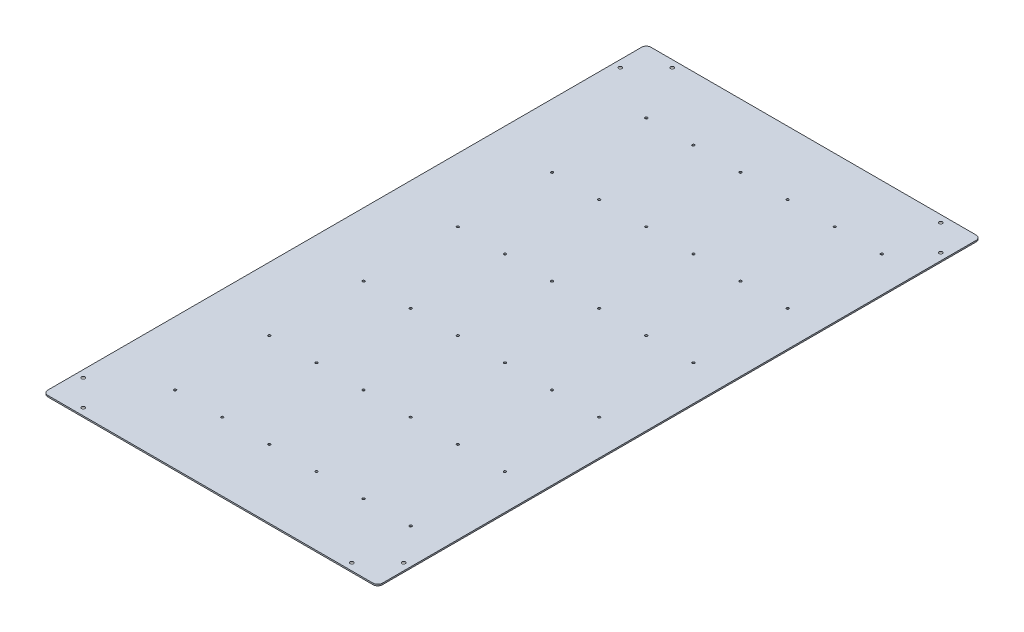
ISO-10303-21;
HEADER;
FILE_DESCRIPTION(('STEP AP214'),'2;1');
FILE_NAME('part.step','',(''),(''),'','','');
FILE_SCHEMA(('AUTOMOTIVE_DESIGN { 1 0 10303 214 1 1 1 1 }'));
ENDSEC;
DATA;
#1=APPLICATION_CONTEXT('core data for automotive mechanical design processes');
#2=APPLICATION_PROTOCOL_DEFINITION('international standard','automotive_design',2000,#1);
#3=PRODUCT_CONTEXT('',#1,'mechanical');
#4=PRODUCT('Part','Part','',(#3));
#5=PRODUCT_RELATED_PRODUCT_CATEGORY('part','',(#4));
#6=PRODUCT_DEFINITION_FORMATION('','',#4);
#7=PRODUCT_DEFINITION_CONTEXT('part definition',#1,'design');
#8=PRODUCT_DEFINITION('design','',#6,#7);
#9=PRODUCT_DEFINITION_SHAPE('','',#8);
#10=(LENGTH_UNIT() NAMED_UNIT(*) SI_UNIT(.MILLI.,.METRE.));
#11=(NAMED_UNIT(*) PLANE_ANGLE_UNIT() SI_UNIT($,.RADIAN.));
#12=(NAMED_UNIT(*) SI_UNIT($,.STERADIAN.) SOLID_ANGLE_UNIT());
#13=UNCERTAINTY_MEASURE_WITH_UNIT(LENGTH_MEASURE(1.E-05),#10,'distance_accuracy_value','');
#14=(GEOMETRIC_REPRESENTATION_CONTEXT(3) GLOBAL_UNCERTAINTY_ASSIGNED_CONTEXT((#13)) GLOBAL_UNIT_ASSIGNED_CONTEXT((#10,
#11,#12)) REPRESENTATION_CONTEXT('',''));
#15=CARTESIAN_POINT('',(0.,0.,0.));
#16=DIRECTION('',(0.,0.,1.));
#17=DIRECTION('',(1.,0.,0.));
#18=AXIS2_PLACEMENT_3D('',#15,#16,#17);
#19=CARTESIAN_POINT('',(280.,3.,-505.));
#20=DIRECTION('',(0.,1.,0.));
#21=DIRECTION('',(0.,0.,1.));
#22=AXIS2_PLACEMENT_3D('',#19,#20,#21);
#23=CYLINDRICAL_SURFACE('',#22,2.5);
#24=CARTESIAN_POINT('',(280.,0.,-505.));
#25=DIRECTION('',(0.,1.,0.));
#26=DIRECTION('',(0.,0.,1.));
#27=AXIS2_PLACEMENT_3D('',#24,#25,#26);
#28=CIRCLE('',#27,2.5);
#29=CARTESIAN_POINT('',(280.,0.,-502.5));
#30=VERTEX_POINT('',#29);
#31=EDGE_CURVE('E416',#30,#30,#28,.T.);
#32=ORIENTED_EDGE('',*,*,#31,.F.);
#33=EDGE_LOOP('',(#32));
#34=FACE_BOUND('',#33,.T.);
#35=CARTESIAN_POINT('',(280.,3.,-505.));
#36=DIRECTION('',(0.,1.,0.));
#37=DIRECTION('',(0.,0.,1.));
#38=AXIS2_PLACEMENT_3D('',#35,#36,#37);
#39=CIRCLE('',#38,2.5);
#40=CARTESIAN_POINT('',(280.,3.,-502.5));
#41=VERTEX_POINT('',#40);
#42=EDGE_CURVE('E420',#41,#41,#39,.T.);
#43=ORIENTED_EDGE('',*,*,#42,.T.);
#44=EDGE_LOOP('',(#43));
#45=FACE_BOUND('',#44,.T.);
#46=ADVANCED_FACE('F51',(#34,#45),#23,.F.);
#47=CARTESIAN_POINT('',(280.,3.,-305.));
#48=DIRECTION('',(0.,1.,0.));
#49=DIRECTION('',(0.,0.,1.));
#50=AXIS2_PLACEMENT_3D('',#47,#48,#49);
#51=CYLINDRICAL_SURFACE('',#50,2.5);
#52=CARTESIAN_POINT('',(280.,0.,-305.));
#53=DIRECTION('',(0.,1.,0.));
#54=DIRECTION('',(0.,0.,1.));
#55=AXIS2_PLACEMENT_3D('',#52,#53,#54);
#56=CIRCLE('',#55,2.5);
#57=CARTESIAN_POINT('',(280.,0.,-302.5));
#58=VERTEX_POINT('',#57);
#59=EDGE_CURVE('E408',#58,#58,#56,.T.);
#60=ORIENTED_EDGE('',*,*,#59,.F.);
#61=EDGE_LOOP('',(#60));
#62=FACE_BOUND('',#61,.T.);
#63=CARTESIAN_POINT('',(280.,3.,-305.));
#64=DIRECTION('',(0.,1.,0.));
#65=DIRECTION('',(0.,0.,1.));
#66=AXIS2_PLACEMENT_3D('',#63,#64,#65);
#67=CIRCLE('',#66,2.5);
#68=CARTESIAN_POINT('',(280.,3.,-302.5));
#69=VERTEX_POINT('',#68);
#70=EDGE_CURVE('E412',#69,#69,#67,.T.);
#71=ORIENTED_EDGE('',*,*,#70,.T.);
#72=EDGE_LOOP('',(#71));
#73=FACE_BOUND('',#72,.T.);
#74=ADVANCED_FACE('F699',(#62,#73),#51,.F.);
#75=CARTESIAN_POINT('',(280.,3.,-105.));
#76=DIRECTION('',(0.,1.,0.));
#77=DIRECTION('',(0.,0.,1.));
#78=AXIS2_PLACEMENT_3D('',#75,#76,#77);
#79=CYLINDRICAL_SURFACE('',#78,2.5);
#80=CARTESIAN_POINT('',(280.,0.,-105.));
#81=DIRECTION('',(0.,1.,0.));
#82=DIRECTION('',(0.,0.,1.));
#83=AXIS2_PLACEMENT_3D('',#80,#81,#82);
#84=CIRCLE('',#83,2.5);
#85=CARTESIAN_POINT('',(280.,0.,-102.5));
#86=VERTEX_POINT('',#85);
#87=EDGE_CURVE('E400',#86,#86,#84,.T.);
#88=ORIENTED_EDGE('',*,*,#87,.F.);
#89=EDGE_LOOP('',(#88));
#90=FACE_BOUND('',#89,.T.);
#91=CARTESIAN_POINT('',(280.,3.,-105.));
#92=DIRECTION('',(0.,1.,0.));
#93=DIRECTION('',(0.,0.,1.));
#94=AXIS2_PLACEMENT_3D('',#91,#92,#93);
#95=CIRCLE('',#94,2.5);
#96=CARTESIAN_POINT('',(280.,3.,-102.5));
#97=VERTEX_POINT('',#96);
#98=EDGE_CURVE('E404',#97,#97,#95,.T.);
#99=ORIENTED_EDGE('',*,*,#98,.T.);
#100=EDGE_LOOP('',(#99));
#101=FACE_BOUND('',#100,.T.);
#102=ADVANCED_FACE('F705',(#90,#101),#79,.F.);
#103=CARTESIAN_POINT('',(280.,3.,94.9999999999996));
#104=DIRECTION('',(0.,1.,0.));
#105=DIRECTION('',(0.,0.,1.));
#106=AXIS2_PLACEMENT_3D('',#103,#104,#105);
#107=CYLINDRICAL_SURFACE('',#106,2.5);
#108=CARTESIAN_POINT('',(280.,0.,94.9999999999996));
#109=DIRECTION('',(0.,1.,0.));
#110=DIRECTION('',(0.,0.,1.));
#111=AXIS2_PLACEMENT_3D('',#108,#109,#110);
#112=CIRCLE('',#111,2.5);
#113=CARTESIAN_POINT('',(280.,0.,97.4999999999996));
#114=VERTEX_POINT('',#113);
#115=EDGE_CURVE('E392',#114,#114,#112,.T.);
#116=ORIENTED_EDGE('',*,*,#115,.F.);
#117=EDGE_LOOP('',(#116));
#118=FACE_BOUND('',#117,.T.);
#119=CARTESIAN_POINT('',(280.,3.,94.9999999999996));
#120=DIRECTION('',(0.,1.,0.));
#121=DIRECTION('',(0.,0.,1.));
#122=AXIS2_PLACEMENT_3D('',#119,#120,#121);
#123=CIRCLE('',#122,2.5);
#124=CARTESIAN_POINT('',(280.,3.,97.4999999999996));
#125=VERTEX_POINT('',#124);
#126=EDGE_CURVE('E396',#125,#125,#123,.T.);
#127=ORIENTED_EDGE('',*,*,#126,.T.);
#128=EDGE_LOOP('',(#127));
#129=FACE_BOUND('',#128,.T.);
#130=ADVANCED_FACE('F855',(#118,#129),#107,.F.);
#131=CARTESIAN_POINT('',(280.,3.,295.));
#132=DIRECTION('',(0.,1.,0.));
#133=DIRECTION('',(0.,0.,1.));
#134=AXIS2_PLACEMENT_3D('',#131,#132,#133);
#135=CYLINDRICAL_SURFACE('',#134,2.5);
#136=CARTESIAN_POINT('',(280.,0.,295.));
#137=DIRECTION('',(0.,1.,0.));
#138=DIRECTION('',(0.,0.,1.));
#139=AXIS2_PLACEMENT_3D('',#136,#137,#138);
#140=CIRCLE('',#139,2.5);
#141=CARTESIAN_POINT('',(280.,0.,297.5));
#142=VERTEX_POINT('',#141);
#143=EDGE_CURVE('E384',#142,#142,#140,.T.);
#144=ORIENTED_EDGE('',*,*,#143,.F.);
#145=EDGE_LOOP('',(#144));
#146=FACE_BOUND('',#145,.T.);
#147=CARTESIAN_POINT('',(280.,3.,295.));
#148=DIRECTION('',(0.,1.,0.));
#149=DIRECTION('',(0.,0.,1.));
#150=AXIS2_PLACEMENT_3D('',#147,#148,#149);
#151=CIRCLE('',#150,2.5);
#152=CARTESIAN_POINT('',(280.,3.,297.5));
#153=VERTEX_POINT('',#152);
#154=EDGE_CURVE('E388',#153,#153,#151,.T.);
#155=ORIENTED_EDGE('',*,*,#154,.T.);
#156=EDGE_LOOP('',(#155));
#157=FACE_BOUND('',#156,.T.);
#158=ADVANCED_FACE('F851',(#146,#157),#135,.F.);
#159=CARTESIAN_POINT('',(280.,3.,495.));
#160=DIRECTION('',(0.,1.,0.));
#161=DIRECTION('',(0.,0.,1.));
#162=AXIS2_PLACEMENT_3D('',#159,#160,#161);
#163=CYLINDRICAL_SURFACE('',#162,2.5);
#164=CARTESIAN_POINT('',(280.,0.,495.));
#165=DIRECTION('',(0.,1.,0.));
#166=DIRECTION('',(0.,0.,1.));
#167=AXIS2_PLACEMENT_3D('',#164,#165,#166);
#168=CIRCLE('',#167,2.5);
#169=CARTESIAN_POINT('',(280.,0.,497.5));
#170=VERTEX_POINT('',#169);
#171=EDGE_CURVE('E376',#170,#170,#168,.T.);
#172=ORIENTED_EDGE('',*,*,#171,.F.);
#173=EDGE_LOOP('',(#172));
#174=FACE_BOUND('',#173,.T.);
#175=CARTESIAN_POINT('',(280.,3.,495.));
#176=DIRECTION('',(0.,1.,0.));
#177=DIRECTION('',(0.,0.,1.));
#178=AXIS2_PLACEMENT_3D('',#175,#176,#177);
#179=CIRCLE('',#178,2.5);
#180=CARTESIAN_POINT('',(280.,3.,497.5));
#181=VERTEX_POINT('',#180);
#182=EDGE_CURVE('E380',#181,#181,#179,.T.);
#183=ORIENTED_EDGE('',*,*,#182,.T.);
#184=EDGE_LOOP('',(#183));
#185=FACE_BOUND('',#184,.T.);
#186=ADVANCED_FACE('F847',(#174,#185),#163,.F.);
#187=CARTESIAN_POINT('',(180.,3.,-505.));
#188=DIRECTION('',(0.,1.,0.));
#189=DIRECTION('',(0.,0.,1.));
#190=AXIS2_PLACEMENT_3D('',#187,#188,#189);
#191=CYLINDRICAL_SURFACE('',#190,2.5);
#192=CARTESIAN_POINT('',(180.,0.,-505.));
#193=DIRECTION('',(0.,1.,0.));
#194=DIRECTION('',(0.,0.,1.));
#195=AXIS2_PLACEMENT_3D('',#192,#193,#194);
#196=CIRCLE('',#195,2.5);
#197=CARTESIAN_POINT('',(180.,0.,-502.5));
#198=VERTEX_POINT('',#197);
#199=EDGE_CURVE('E368',#198,#198,#196,.T.);
#200=ORIENTED_EDGE('',*,*,#199,.F.);
#201=EDGE_LOOP('',(#200));
#202=FACE_BOUND('',#201,.T.);
#203=CARTESIAN_POINT('',(180.,3.,-505.));
#204=DIRECTION('',(0.,1.,0.));
#205=DIRECTION('',(0.,0.,1.));
#206=AXIS2_PLACEMENT_3D('',#203,#204,#205);
#207=CIRCLE('',#206,2.5);
#208=CARTESIAN_POINT('',(180.,3.,-502.5));
#209=VERTEX_POINT('',#208);
#210=EDGE_CURVE('E372',#209,#209,#207,.T.);
#211=ORIENTED_EDGE('',*,*,#210,.T.);
#212=EDGE_LOOP('',(#211));
#213=FACE_BOUND('',#212,.T.);
#214=ADVANCED_FACE('F843',(#202,#213),#191,.F.);
#215=CARTESIAN_POINT('',(180.,3.,495.));
#216=DIRECTION('',(0.,1.,0.));
#217=DIRECTION('',(0.,0.,1.));
#218=AXIS2_PLACEMENT_3D('',#215,#216,#217);
#219=CYLINDRICAL_SURFACE('',#218,2.5);
#220=CARTESIAN_POINT('',(180.,0.,495.));
#221=DIRECTION('',(0.,1.,0.));
#222=DIRECTION('',(0.,0.,1.));
#223=AXIS2_PLACEMENT_3D('',#220,#221,#222);
#224=CIRCLE('',#223,2.5);
#225=CARTESIAN_POINT('',(180.,0.,497.5));
#226=VERTEX_POINT('',#225);
#227=EDGE_CURVE('E360',#226,#226,#224,.T.);
#228=ORIENTED_EDGE('',*,*,#227,.F.);
#229=EDGE_LOOP('',(#228));
#230=FACE_BOUND('',#229,.T.);
#231=CARTESIAN_POINT('',(180.,3.,495.));
#232=DIRECTION('',(0.,1.,0.));
#233=DIRECTION('',(0.,0.,1.));
#234=AXIS2_PLACEMENT_3D('',#231,#232,#233);
#235=CIRCLE('',#234,2.5);
#236=CARTESIAN_POINT('',(180.,3.,497.5));
#237=VERTEX_POINT('',#236);
#238=EDGE_CURVE('E364',#237,#237,#235,.T.);
#239=ORIENTED_EDGE('',*,*,#238,.T.);
#240=EDGE_LOOP('',(#239));
#241=FACE_BOUND('',#240,.T.);
#242=ADVANCED_FACE('F839',(#230,#241),#219,.F.);
#243=CARTESIAN_POINT('',(79.9999999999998,3.,-505.));
#244=DIRECTION('',(0.,1.,0.));
#245=DIRECTION('',(0.,0.,1.));
#246=AXIS2_PLACEMENT_3D('',#243,#244,#245);
#247=CYLINDRICAL_SURFACE('',#246,2.5);
#248=CARTESIAN_POINT('',(79.9999999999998,0.,-505.));
#249=DIRECTION('',(0.,1.,0.));
#250=DIRECTION('',(0.,0.,1.));
#251=AXIS2_PLACEMENT_3D('',#248,#249,#250);
#252=CIRCLE('',#251,2.5);
#253=CARTESIAN_POINT('',(79.9999999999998,0.,-502.5));
#254=VERTEX_POINT('',#253);
#255=EDGE_CURVE('E352',#254,#254,#252,.T.);
#256=ORIENTED_EDGE('',*,*,#255,.F.);
#257=EDGE_LOOP('',(#256));
#258=FACE_BOUND('',#257,.T.);
#259=CARTESIAN_POINT('',(79.9999999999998,3.,-505.));
#260=DIRECTION('',(0.,1.,0.));
#261=DIRECTION('',(0.,0.,1.));
#262=AXIS2_PLACEMENT_3D('',#259,#260,#261);
#263=CIRCLE('',#262,2.5);
#264=CARTESIAN_POINT('',(79.9999999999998,3.,-502.5));
#265=VERTEX_POINT('',#264);
#266=EDGE_CURVE('E356',#265,#265,#263,.T.);
#267=ORIENTED_EDGE('',*,*,#266,.T.);
#268=EDGE_LOOP('',(#267));
#269=FACE_BOUND('',#268,.T.);
#270=ADVANCED_FACE('F835',(#258,#269),#247,.F.);
#271=CARTESIAN_POINT('',(80.,3.,495.));
#272=DIRECTION('',(0.,1.,0.));
#273=DIRECTION('',(0.,0.,1.));
#274=AXIS2_PLACEMENT_3D('',#271,#272,#273);
#275=CYLINDRICAL_SURFACE('',#274,2.5);
#276=CARTESIAN_POINT('',(80.,0.,495.));
#277=DIRECTION('',(0.,1.,0.));
#278=DIRECTION('',(0.,0.,1.));
#279=AXIS2_PLACEMENT_3D('',#276,#277,#278);
#280=CIRCLE('',#279,2.5);
#281=CARTESIAN_POINT('',(80.,0.,497.5));
#282=VERTEX_POINT('',#281);
#283=EDGE_CURVE('E344',#282,#282,#280,.T.);
#284=ORIENTED_EDGE('',*,*,#283,.F.);
#285=EDGE_LOOP('',(#284));
#286=FACE_BOUND('',#285,.T.);
#287=CARTESIAN_POINT('',(80.,3.,495.));
#288=DIRECTION('',(0.,1.,0.));
#289=DIRECTION('',(0.,0.,1.));
#290=AXIS2_PLACEMENT_3D('',#287,#288,#289);
#291=CIRCLE('',#290,2.5);
#292=CARTESIAN_POINT('',(80.,3.,497.5));
#293=VERTEX_POINT('',#292);
#294=EDGE_CURVE('E348',#293,#293,#291,.T.);
#295=ORIENTED_EDGE('',*,*,#294,.T.);
#296=EDGE_LOOP('',(#295));
#297=FACE_BOUND('',#296,.T.);
#298=ADVANCED_FACE('F831',(#286,#297),#275,.F.);
#299=CARTESIAN_POINT('',(-20.0000000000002,3.,-505.));
#300=DIRECTION('',(0.,1.,0.));
#301=DIRECTION('',(0.,0.,1.));
#302=AXIS2_PLACEMENT_3D('',#299,#300,#301);
#303=CYLINDRICAL_SURFACE('',#302,2.5);
#304=CARTESIAN_POINT('',(-20.0000000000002,0.,-505.));
#305=DIRECTION('',(0.,1.,0.));
#306=DIRECTION('',(0.,0.,1.));
#307=AXIS2_PLACEMENT_3D('',#304,#305,#306);
#308=CIRCLE('',#307,2.5);
#309=CARTESIAN_POINT('',(-20.0000000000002,0.,-502.5));
#310=VERTEX_POINT('',#309);
#311=EDGE_CURVE('E336',#310,#310,#308,.T.);
#312=ORIENTED_EDGE('',*,*,#311,.F.);
#313=EDGE_LOOP('',(#312));
#314=FACE_BOUND('',#313,.T.);
#315=CARTESIAN_POINT('',(-20.0000000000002,3.,-505.));
#316=DIRECTION('',(0.,1.,0.));
#317=DIRECTION('',(0.,0.,1.));
#318=AXIS2_PLACEMENT_3D('',#315,#316,#317);
#319=CIRCLE('',#318,2.5);
#320=CARTESIAN_POINT('',(-20.0000000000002,3.,-502.5));
#321=VERTEX_POINT('',#320);
#322=EDGE_CURVE('E340',#321,#321,#319,.T.);
#323=ORIENTED_EDGE('',*,*,#322,.T.);
#324=EDGE_LOOP('',(#323));
#325=FACE_BOUND('',#324,.T.);
#326=ADVANCED_FACE('F827',(#314,#325),#303,.F.);
#327=CARTESIAN_POINT('',(-20.,3.,495.));
#328=DIRECTION('',(0.,1.,0.));
#329=DIRECTION('',(0.,0.,1.));
#330=AXIS2_PLACEMENT_3D('',#327,#328,#329);
#331=CYLINDRICAL_SURFACE('',#330,2.5);
#332=CARTESIAN_POINT('',(-20.,0.,495.));
#333=DIRECTION('',(0.,1.,0.));
#334=DIRECTION('',(0.,0.,1.));
#335=AXIS2_PLACEMENT_3D('',#332,#333,#334);
#336=CIRCLE('',#335,2.5);
#337=CARTESIAN_POINT('',(-20.,0.,497.5));
#338=VERTEX_POINT('',#337);
#339=EDGE_CURVE('E328',#338,#338,#336,.T.);
#340=ORIENTED_EDGE('',*,*,#339,.F.);
#341=EDGE_LOOP('',(#340));
#342=FACE_BOUND('',#341,.T.);
#343=CARTESIAN_POINT('',(-20.,3.,495.));
#344=DIRECTION('',(0.,1.,0.));
#345=DIRECTION('',(0.,0.,1.));
#346=AXIS2_PLACEMENT_3D('',#343,#344,#345);
#347=CIRCLE('',#346,2.5);
#348=CARTESIAN_POINT('',(-20.,3.,497.5));
#349=VERTEX_POINT('',#348);
#350=EDGE_CURVE('E332',#349,#349,#347,.T.);
#351=ORIENTED_EDGE('',*,*,#350,.T.);
#352=EDGE_LOOP('',(#351));
#353=FACE_BOUND('',#352,.T.);
#354=ADVANCED_FACE('F823',(#342,#353),#331,.F.);
#355=CARTESIAN_POINT('',(-120.,3.,-505.));
#356=DIRECTION('',(0.,1.,0.));
#357=DIRECTION('',(0.,0.,1.));
#358=AXIS2_PLACEMENT_3D('',#355,#356,#357);
#359=CYLINDRICAL_SURFACE('',#358,2.5);
#360=CARTESIAN_POINT('',(-120.,0.,-505.));
#361=DIRECTION('',(0.,1.,0.));
#362=DIRECTION('',(0.,0.,1.));
#363=AXIS2_PLACEMENT_3D('',#360,#361,#362);
#364=CIRCLE('',#363,2.5);
#365=CARTESIAN_POINT('',(-120.,0.,-502.5));
#366=VERTEX_POINT('',#365);
#367=EDGE_CURVE('E320',#366,#366,#364,.T.);
#368=ORIENTED_EDGE('',*,*,#367,.F.);
#369=EDGE_LOOP('',(#368));
#370=FACE_BOUND('',#369,.T.);
#371=CARTESIAN_POINT('',(-120.,3.,-505.));
#372=DIRECTION('',(0.,1.,0.));
#373=DIRECTION('',(0.,0.,1.));
#374=AXIS2_PLACEMENT_3D('',#371,#372,#373);
#375=CIRCLE('',#374,2.5);
#376=CARTESIAN_POINT('',(-120.,3.,-502.5));
#377=VERTEX_POINT('',#376);
#378=EDGE_CURVE('E324',#377,#377,#375,.T.);
#379=ORIENTED_EDGE('',*,*,#378,.T.);
#380=EDGE_LOOP('',(#379));
#381=FACE_BOUND('',#380,.T.);
#382=ADVANCED_FACE('F819',(#370,#381),#359,.F.);
#383=CARTESIAN_POINT('',(-120.,3.,495.));
#384=DIRECTION('',(0.,1.,0.));
#385=DIRECTION('',(0.,0.,1.));
#386=AXIS2_PLACEMENT_3D('',#383,#384,#385);
#387=CYLINDRICAL_SURFACE('',#386,2.5);
#388=CARTESIAN_POINT('',(-120.,0.,495.));
#389=DIRECTION('',(0.,1.,0.));
#390=DIRECTION('',(0.,0.,1.));
#391=AXIS2_PLACEMENT_3D('',#388,#389,#390);
#392=CIRCLE('',#391,2.5);
#393=CARTESIAN_POINT('',(-120.,0.,497.5));
#394=VERTEX_POINT('',#393);
#395=EDGE_CURVE('E312',#394,#394,#392,.T.);
#396=ORIENTED_EDGE('',*,*,#395,.F.);
#397=EDGE_LOOP('',(#396));
#398=FACE_BOUND('',#397,.T.);
#399=CARTESIAN_POINT('',(-120.,3.,495.));
#400=DIRECTION('',(0.,1.,0.));
#401=DIRECTION('',(0.,0.,1.));
#402=AXIS2_PLACEMENT_3D('',#399,#400,#401);
#403=CIRCLE('',#402,2.5);
#404=CARTESIAN_POINT('',(-120.,3.,497.5));
#405=VERTEX_POINT('',#404);
#406=EDGE_CURVE('E316',#405,#405,#403,.T.);
#407=ORIENTED_EDGE('',*,*,#406,.T.);
#408=EDGE_LOOP('',(#407));
#409=FACE_BOUND('',#408,.T.);
#410=ADVANCED_FACE('F815',(#398,#409),#387,.F.);
#411=CARTESIAN_POINT('',(-220.,3.,-505.));
#412=DIRECTION('',(0.,1.,0.));
#413=DIRECTION('',(0.,0.,1.));
#414=AXIS2_PLACEMENT_3D('',#411,#412,#413);
#415=CYLINDRICAL_SURFACE('',#414,2.5);
#416=CARTESIAN_POINT('',(-220.,0.,-505.));
#417=DIRECTION('',(0.,1.,0.));
#418=DIRECTION('',(0.,0.,1.));
#419=AXIS2_PLACEMENT_3D('',#416,#417,#418);
#420=CIRCLE('',#419,2.5);
#421=CARTESIAN_POINT('',(-220.,0.,-502.5));
#422=VERTEX_POINT('',#421);
#423=EDGE_CURVE('E304',#422,#422,#420,.T.);
#424=ORIENTED_EDGE('',*,*,#423,.F.);
#425=EDGE_LOOP('',(#424));
#426=FACE_BOUND('',#425,.T.);
#427=CARTESIAN_POINT('',(-220.,3.,-505.));
#428=DIRECTION('',(0.,1.,0.));
#429=DIRECTION('',(0.,0.,1.));
#430=AXIS2_PLACEMENT_3D('',#427,#428,#429);
#431=CIRCLE('',#430,2.5);
#432=CARTESIAN_POINT('',(-220.,3.,-502.5));
#433=VERTEX_POINT('',#432);
#434=EDGE_CURVE('E308',#433,#433,#431,.T.);
#435=ORIENTED_EDGE('',*,*,#434,.T.);
#436=EDGE_LOOP('',(#435));
#437=FACE_BOUND('',#436,.T.);
#438=ADVANCED_FACE('F811',(#426,#437),#415,.F.);
#439=CARTESIAN_POINT('',(-220.,3.,-305.));
#440=DIRECTION('',(0.,1.,0.));
#441=DIRECTION('',(0.,0.,1.));
#442=AXIS2_PLACEMENT_3D('',#439,#440,#441);
#443=CYLINDRICAL_SURFACE('',#442,2.5);
#444=CARTESIAN_POINT('',(-220.,0.,-305.));
#445=DIRECTION('',(0.,1.,0.));
#446=DIRECTION('',(0.,0.,1.));
#447=AXIS2_PLACEMENT_3D('',#444,#445,#446);
#448=CIRCLE('',#447,2.5);
#449=CARTESIAN_POINT('',(-220.,0.,-302.5));
#450=VERTEX_POINT('',#449);
#451=EDGE_CURVE('E296',#450,#450,#448,.T.);
#452=ORIENTED_EDGE('',*,*,#451,.F.);
#453=EDGE_LOOP('',(#452));
#454=FACE_BOUND('',#453,.T.);
#455=CARTESIAN_POINT('',(-220.,3.,-305.));
#456=DIRECTION('',(0.,1.,0.));
#457=DIRECTION('',(0.,0.,1.));
#458=AXIS2_PLACEMENT_3D('',#455,#456,#457);
#459=CIRCLE('',#458,2.5);
#460=CARTESIAN_POINT('',(-220.,3.,-302.5));
#461=VERTEX_POINT('',#460);
#462=EDGE_CURVE('E300',#461,#461,#459,.T.);
#463=ORIENTED_EDGE('',*,*,#462,.T.);
#464=EDGE_LOOP('',(#463));
#465=FACE_BOUND('',#464,.T.);
#466=ADVANCED_FACE('F807',(#454,#465),#443,.F.);
#467=CARTESIAN_POINT('',(-220.,3.,-105.));
#468=DIRECTION('',(0.,1.,0.));
#469=DIRECTION('',(0.,0.,1.));
#470=AXIS2_PLACEMENT_3D('',#467,#468,#469);
#471=CYLINDRICAL_SURFACE('',#470,2.5);
#472=CARTESIAN_POINT('',(-220.,0.,-105.));
#473=DIRECTION('',(0.,1.,0.));
#474=DIRECTION('',(0.,0.,1.));
#475=AXIS2_PLACEMENT_3D('',#472,#473,#474);
#476=CIRCLE('',#475,2.5);
#477=CARTESIAN_POINT('',(-220.,0.,-102.5));
#478=VERTEX_POINT('',#477);
#479=EDGE_CURVE('E288',#478,#478,#476,.T.);
#480=ORIENTED_EDGE('',*,*,#479,.F.);
#481=EDGE_LOOP('',(#480));
#482=FACE_BOUND('',#481,.T.);
#483=CARTESIAN_POINT('',(-220.,3.,-105.));
#484=DIRECTION('',(0.,1.,0.));
#485=DIRECTION('',(0.,0.,1.));
#486=AXIS2_PLACEMENT_3D('',#483,#484,#485);
#487=CIRCLE('',#486,2.5);
#488=CARTESIAN_POINT('',(-220.,3.,-102.5));
#489=VERTEX_POINT('',#488);
#490=EDGE_CURVE('E292',#489,#489,#487,.T.);
#491=ORIENTED_EDGE('',*,*,#490,.T.);
#492=EDGE_LOOP('',(#491));
#493=FACE_BOUND('',#492,.T.);
#494=ADVANCED_FACE('F803',(#482,#493),#471,.F.);
#495=CARTESIAN_POINT('',(-220.,3.,94.9999999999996));
#496=DIRECTION('',(0.,1.,0.));
#497=DIRECTION('',(0.,0.,1.));
#498=AXIS2_PLACEMENT_3D('',#495,#496,#497);
#499=CYLINDRICAL_SURFACE('',#498,2.5);
#500=CARTESIAN_POINT('',(-220.,0.,94.9999999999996));
#501=DIRECTION('',(0.,1.,0.));
#502=DIRECTION('',(0.,0.,1.));
#503=AXIS2_PLACEMENT_3D('',#500,#501,#502);
#504=CIRCLE('',#503,2.5);
#505=CARTESIAN_POINT('',(-220.,0.,97.4999999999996));
#506=VERTEX_POINT('',#505);
#507=EDGE_CURVE('E280',#506,#506,#504,.T.);
#508=ORIENTED_EDGE('',*,*,#507,.F.);
#509=EDGE_LOOP('',(#508));
#510=FACE_BOUND('',#509,.T.);
#511=CARTESIAN_POINT('',(-220.,3.,94.9999999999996));
#512=DIRECTION('',(0.,1.,0.));
#513=DIRECTION('',(0.,0.,1.));
#514=AXIS2_PLACEMENT_3D('',#511,#512,#513);
#515=CIRCLE('',#514,2.5);
#516=CARTESIAN_POINT('',(-220.,3.,97.4999999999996));
#517=VERTEX_POINT('',#516);
#518=EDGE_CURVE('E284',#517,#517,#515,.T.);
#519=ORIENTED_EDGE('',*,*,#518,.T.);
#520=EDGE_LOOP('',(#519));
#521=FACE_BOUND('',#520,.T.);
#522=ADVANCED_FACE('F799',(#510,#521),#499,.F.);
#523=CARTESIAN_POINT('',(180.,3.,-305.));
#524=DIRECTION('',(0.,1.,0.));
#525=DIRECTION('',(0.,0.,1.));
#526=AXIS2_PLACEMENT_3D('',#523,#524,#525);
#527=CYLINDRICAL_SURFACE('',#526,2.5);
#528=CARTESIAN_POINT('',(180.,0.,-305.));
#529=DIRECTION('',(0.,1.,0.));
#530=DIRECTION('',(0.,0.,1.));
#531=AXIS2_PLACEMENT_3D('',#528,#529,#530);
#532=CIRCLE('',#531,2.5);
#533=CARTESIAN_POINT('',(180.,0.,-302.5));
#534=VERTEX_POINT('',#533);
#535=EDGE_CURVE('E272',#534,#534,#532,.T.);
#536=ORIENTED_EDGE('',*,*,#535,.F.);
#537=EDGE_LOOP('',(#536));
#538=FACE_BOUND('',#537,.T.);
#539=CARTESIAN_POINT('',(180.,3.,-305.));
#540=DIRECTION('',(0.,1.,0.));
#541=DIRECTION('',(0.,0.,1.));
#542=AXIS2_PLACEMENT_3D('',#539,#540,#541);
#543=CIRCLE('',#542,2.5);
#544=CARTESIAN_POINT('',(180.,3.,-302.5));
#545=VERTEX_POINT('',#544);
#546=EDGE_CURVE('E276',#545,#545,#543,.T.);
#547=ORIENTED_EDGE('',*,*,#546,.T.);
#548=EDGE_LOOP('',(#547));
#549=FACE_BOUND('',#548,.T.);
#550=ADVANCED_FACE('F795',(#538,#549),#527,.F.);
#551=CARTESIAN_POINT('',(180.,3.,-105.));
#552=DIRECTION('',(0.,1.,0.));
#553=DIRECTION('',(0.,0.,1.));
#554=AXIS2_PLACEMENT_3D('',#551,#552,#553);
#555=CYLINDRICAL_SURFACE('',#554,2.5);
#556=CARTESIAN_POINT('',(180.,0.,-105.));
#557=DIRECTION('',(0.,1.,0.));
#558=DIRECTION('',(0.,0.,1.));
#559=AXIS2_PLACEMENT_3D('',#556,#557,#558);
#560=CIRCLE('',#559,2.5);
#561=CARTESIAN_POINT('',(180.,0.,-102.5));
#562=VERTEX_POINT('',#561);
#563=EDGE_CURVE('E264',#562,#562,#560,.T.);
#564=ORIENTED_EDGE('',*,*,#563,.F.);
#565=EDGE_LOOP('',(#564));
#566=FACE_BOUND('',#565,.T.);
#567=CARTESIAN_POINT('',(180.,3.,-105.));
#568=DIRECTION('',(0.,1.,0.));
#569=DIRECTION('',(0.,0.,1.));
#570=AXIS2_PLACEMENT_3D('',#567,#568,#569);
#571=CIRCLE('',#570,2.5);
#572=CARTESIAN_POINT('',(180.,3.,-102.5));
#573=VERTEX_POINT('',#572);
#574=EDGE_CURVE('E268',#573,#573,#571,.T.);
#575=ORIENTED_EDGE('',*,*,#574,.T.);
#576=EDGE_LOOP('',(#575));
#577=FACE_BOUND('',#576,.T.);
#578=ADVANCED_FACE('F791',(#566,#577),#555,.F.);
#579=CARTESIAN_POINT('',(180.,3.,94.9999999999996));
#580=DIRECTION('',(0.,1.,0.));
#581=DIRECTION('',(0.,0.,1.));
#582=AXIS2_PLACEMENT_3D('',#579,#580,#581);
#583=CYLINDRICAL_SURFACE('',#582,2.5);
#584=CARTESIAN_POINT('',(180.,0.,94.9999999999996));
#585=DIRECTION('',(0.,1.,0.));
#586=DIRECTION('',(0.,0.,1.));
#587=AXIS2_PLACEMENT_3D('',#584,#585,#586);
#588=CIRCLE('',#587,2.5);
#589=CARTESIAN_POINT('',(180.,0.,97.4999999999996));
#590=VERTEX_POINT('',#589);
#591=EDGE_CURVE('E256',#590,#590,#588,.T.);
#592=ORIENTED_EDGE('',*,*,#591,.F.);
#593=EDGE_LOOP('',(#592));
#594=FACE_BOUND('',#593,.T.);
#595=CARTESIAN_POINT('',(180.,3.,94.9999999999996));
#596=DIRECTION('',(0.,1.,0.));
#597=DIRECTION('',(0.,0.,1.));
#598=AXIS2_PLACEMENT_3D('',#595,#596,#597);
#599=CIRCLE('',#598,2.5);
#600=CARTESIAN_POINT('',(180.,3.,97.4999999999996));
#601=VERTEX_POINT('',#600);
#602=EDGE_CURVE('E260',#601,#601,#599,.T.);
#603=ORIENTED_EDGE('',*,*,#602,.T.);
#604=EDGE_LOOP('',(#603));
#605=FACE_BOUND('',#604,.T.);
#606=ADVANCED_FACE('F787',(#594,#605),#583,.F.);
#607=CARTESIAN_POINT('',(180.,3.,295.));
#608=DIRECTION('',(0.,1.,0.));
#609=DIRECTION('',(0.,0.,1.));
#610=AXIS2_PLACEMENT_3D('',#607,#608,#609);
#611=CYLINDRICAL_SURFACE('',#610,2.5);
#612=CARTESIAN_POINT('',(180.,0.,295.));
#613=DIRECTION('',(0.,1.,0.));
#614=DIRECTION('',(0.,0.,1.));
#615=AXIS2_PLACEMENT_3D('',#612,#613,#614);
#616=CIRCLE('',#615,2.5);
#617=CARTESIAN_POINT('',(180.,0.,297.5));
#618=VERTEX_POINT('',#617);
#619=EDGE_CURVE('E248',#618,#618,#616,.T.);
#620=ORIENTED_EDGE('',*,*,#619,.F.);
#621=EDGE_LOOP('',(#620));
#622=FACE_BOUND('',#621,.T.);
#623=CARTESIAN_POINT('',(180.,3.,295.));
#624=DIRECTION('',(0.,1.,0.));
#625=DIRECTION('',(0.,0.,1.));
#626=AXIS2_PLACEMENT_3D('',#623,#624,#625);
#627=CIRCLE('',#626,2.5);
#628=CARTESIAN_POINT('',(180.,3.,297.5));
#629=VERTEX_POINT('',#628);
#630=EDGE_CURVE('E252',#629,#629,#627,.T.);
#631=ORIENTED_EDGE('',*,*,#630,.T.);
#632=EDGE_LOOP('',(#631));
#633=FACE_BOUND('',#632,.T.);
#634=ADVANCED_FACE('F783',(#622,#633),#611,.F.);
#635=CARTESIAN_POINT('',(79.9999999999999,3.,-305.));
#636=DIRECTION('',(0.,1.,0.));
#637=DIRECTION('',(0.,0.,1.));
#638=AXIS2_PLACEMENT_3D('',#635,#636,#637);
#639=CYLINDRICAL_SURFACE('',#638,2.5);
#640=CARTESIAN_POINT('',(79.9999999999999,0.,-305.));
#641=DIRECTION('',(0.,1.,0.));
#642=DIRECTION('',(0.,0.,1.));
#643=AXIS2_PLACEMENT_3D('',#640,#641,#642);
#644=CIRCLE('',#643,2.5);
#645=CARTESIAN_POINT('',(79.9999999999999,0.,-302.5));
#646=VERTEX_POINT('',#645);
#647=EDGE_CURVE('E240',#646,#646,#644,.T.);
#648=ORIENTED_EDGE('',*,*,#647,.F.);
#649=EDGE_LOOP('',(#648));
#650=FACE_BOUND('',#649,.T.);
#651=CARTESIAN_POINT('',(79.9999999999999,3.,-305.));
#652=DIRECTION('',(0.,1.,0.));
#653=DIRECTION('',(0.,0.,1.));
#654=AXIS2_PLACEMENT_3D('',#651,#652,#653);
#655=CIRCLE('',#654,2.5);
#656=CARTESIAN_POINT('',(79.9999999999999,3.,-302.5));
#657=VERTEX_POINT('',#656);
#658=EDGE_CURVE('E244',#657,#657,#655,.T.);
#659=ORIENTED_EDGE('',*,*,#658,.T.);
#660=EDGE_LOOP('',(#659));
#661=FACE_BOUND('',#660,.T.);
#662=ADVANCED_FACE('F779',(#650,#661),#639,.F.);
#663=CARTESIAN_POINT('',(79.9999999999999,3.,-105.));
#664=DIRECTION('',(0.,1.,0.));
#665=DIRECTION('',(0.,0.,1.));
#666=AXIS2_PLACEMENT_3D('',#663,#664,#665);
#667=CYLINDRICAL_SURFACE('',#666,2.5);
#668=CARTESIAN_POINT('',(79.9999999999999,0.,-105.));
#669=DIRECTION('',(0.,1.,0.));
#670=DIRECTION('',(0.,0.,1.));
#671=AXIS2_PLACEMENT_3D('',#668,#669,#670);
#672=CIRCLE('',#671,2.5);
#673=CARTESIAN_POINT('',(79.9999999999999,0.,-102.5));
#674=VERTEX_POINT('',#673);
#675=EDGE_CURVE('E232',#674,#674,#672,.T.);
#676=ORIENTED_EDGE('',*,*,#675,.F.);
#677=EDGE_LOOP('',(#676));
#678=FACE_BOUND('',#677,.T.);
#679=CARTESIAN_POINT('',(79.9999999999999,3.,-105.));
#680=DIRECTION('',(0.,1.,0.));
#681=DIRECTION('',(0.,0.,1.));
#682=AXIS2_PLACEMENT_3D('',#679,#680,#681);
#683=CIRCLE('',#682,2.5);
#684=CARTESIAN_POINT('',(79.9999999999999,3.,-102.5));
#685=VERTEX_POINT('',#684);
#686=EDGE_CURVE('E236',#685,#685,#683,.T.);
#687=ORIENTED_EDGE('',*,*,#686,.T.);
#688=EDGE_LOOP('',(#687));
#689=FACE_BOUND('',#688,.T.);
#690=ADVANCED_FACE('F775',(#678,#689),#667,.F.);
#691=CARTESIAN_POINT('',(79.9999999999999,3.,94.9999999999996));
#692=DIRECTION('',(0.,1.,0.));
#693=DIRECTION('',(0.,0.,1.));
#694=AXIS2_PLACEMENT_3D('',#691,#692,#693);
#695=CYLINDRICAL_SURFACE('',#694,2.5);
#696=CARTESIAN_POINT('',(79.9999999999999,0.,94.9999999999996));
#697=DIRECTION('',(0.,1.,0.));
#698=DIRECTION('',(0.,0.,1.));
#699=AXIS2_PLACEMENT_3D('',#696,#697,#698);
#700=CIRCLE('',#699,2.5);
#701=CARTESIAN_POINT('',(79.9999999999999,0.,97.4999999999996));
#702=VERTEX_POINT('',#701);
#703=EDGE_CURVE('E224',#702,#702,#700,.T.);
#704=ORIENTED_EDGE('',*,*,#703,.F.);
#705=EDGE_LOOP('',(#704));
#706=FACE_BOUND('',#705,.T.);
#707=CARTESIAN_POINT('',(79.9999999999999,3.,94.9999999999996));
#708=DIRECTION('',(0.,1.,0.));
#709=DIRECTION('',(0.,0.,1.));
#710=AXIS2_PLACEMENT_3D('',#707,#708,#709);
#711=CIRCLE('',#710,2.5);
#712=CARTESIAN_POINT('',(79.9999999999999,3.,97.4999999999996));
#713=VERTEX_POINT('',#712);
#714=EDGE_CURVE('E228',#713,#713,#711,.T.);
#715=ORIENTED_EDGE('',*,*,#714,.T.);
#716=EDGE_LOOP('',(#715));
#717=FACE_BOUND('',#716,.T.);
#718=ADVANCED_FACE('F771',(#706,#717),#695,.F.);
#719=CARTESIAN_POINT('',(80.,3.,295.));
#720=DIRECTION('',(0.,1.,0.));
#721=DIRECTION('',(0.,0.,1.));
#722=AXIS2_PLACEMENT_3D('',#719,#720,#721);
#723=CYLINDRICAL_SURFACE('',#722,2.5);
#724=CARTESIAN_POINT('',(80.,0.,295.));
#725=DIRECTION('',(0.,1.,0.));
#726=DIRECTION('',(0.,0.,1.));
#727=AXIS2_PLACEMENT_3D('',#724,#725,#726);
#728=CIRCLE('',#727,2.5);
#729=CARTESIAN_POINT('',(80.,0.,297.5));
#730=VERTEX_POINT('',#729);
#731=EDGE_CURVE('E216',#730,#730,#728,.T.);
#732=ORIENTED_EDGE('',*,*,#731,.F.);
#733=EDGE_LOOP('',(#732));
#734=FACE_BOUND('',#733,.T.);
#735=CARTESIAN_POINT('',(80.,3.,295.));
#736=DIRECTION('',(0.,1.,0.));
#737=DIRECTION('',(0.,0.,1.));
#738=AXIS2_PLACEMENT_3D('',#735,#736,#737);
#739=CIRCLE('',#738,2.5);
#740=CARTESIAN_POINT('',(80.,3.,297.5));
#741=VERTEX_POINT('',#740);
#742=EDGE_CURVE('E220',#741,#741,#739,.T.);
#743=ORIENTED_EDGE('',*,*,#742,.T.);
#744=EDGE_LOOP('',(#743));
#745=FACE_BOUND('',#744,.T.);
#746=ADVANCED_FACE('F767',(#734,#745),#723,.F.);
#747=CARTESIAN_POINT('',(-20.0000000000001,3.,-305.));
#748=DIRECTION('',(0.,1.,0.));
#749=DIRECTION('',(0.,0.,1.));
#750=AXIS2_PLACEMENT_3D('',#747,#748,#749);
#751=CYLINDRICAL_SURFACE('',#750,2.5);
#752=CARTESIAN_POINT('',(-20.0000000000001,0.,-305.));
#753=DIRECTION('',(0.,1.,0.));
#754=DIRECTION('',(0.,0.,1.));
#755=AXIS2_PLACEMENT_3D('',#752,#753,#754);
#756=CIRCLE('',#755,2.5);
#757=CARTESIAN_POINT('',(-20.0000000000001,0.,-302.5));
#758=VERTEX_POINT('',#757);
#759=EDGE_CURVE('E208',#758,#758,#756,.T.);
#760=ORIENTED_EDGE('',*,*,#759,.F.);
#761=EDGE_LOOP('',(#760));
#762=FACE_BOUND('',#761,.T.);
#763=CARTESIAN_POINT('',(-20.0000000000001,3.,-305.));
#764=DIRECTION('',(0.,1.,0.));
#765=DIRECTION('',(0.,0.,1.));
#766=AXIS2_PLACEMENT_3D('',#763,#764,#765);
#767=CIRCLE('',#766,2.5);
#768=CARTESIAN_POINT('',(-20.0000000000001,3.,-302.5));
#769=VERTEX_POINT('',#768);
#770=EDGE_CURVE('E212',#769,#769,#767,.T.);
#771=ORIENTED_EDGE('',*,*,#770,.T.);
#772=EDGE_LOOP('',(#771));
#773=FACE_BOUND('',#772,.T.);
#774=ADVANCED_FACE('F763',(#762,#773),#751,.F.);
#775=CARTESIAN_POINT('',(-20.0000000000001,3.,-105.));
#776=DIRECTION('',(0.,1.,0.));
#777=DIRECTION('',(0.,0.,1.));
#778=AXIS2_PLACEMENT_3D('',#775,#776,#777);
#779=CYLINDRICAL_SURFACE('',#778,2.5);
#780=CARTESIAN_POINT('',(-20.0000000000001,0.,-105.));
#781=DIRECTION('',(0.,1.,0.));
#782=DIRECTION('',(0.,0.,1.));
#783=AXIS2_PLACEMENT_3D('',#780,#781,#782);
#784=CIRCLE('',#783,2.5);
#785=CARTESIAN_POINT('',(-20.0000000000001,0.,-102.5));
#786=VERTEX_POINT('',#785);
#787=EDGE_CURVE('E200',#786,#786,#784,.T.);
#788=ORIENTED_EDGE('',*,*,#787,.F.);
#789=EDGE_LOOP('',(#788));
#790=FACE_BOUND('',#789,.T.);
#791=CARTESIAN_POINT('',(-20.0000000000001,3.,-105.));
#792=DIRECTION('',(0.,1.,0.));
#793=DIRECTION('',(0.,0.,1.));
#794=AXIS2_PLACEMENT_3D('',#791,#792,#793);
#795=CIRCLE('',#794,2.5);
#796=CARTESIAN_POINT('',(-20.0000000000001,3.,-102.5));
#797=VERTEX_POINT('',#796);
#798=EDGE_CURVE('E204',#797,#797,#795,.T.);
#799=ORIENTED_EDGE('',*,*,#798,.T.);
#800=EDGE_LOOP('',(#799));
#801=FACE_BOUND('',#800,.T.);
#802=ADVANCED_FACE('F759',(#790,#801),#779,.F.);
#803=CARTESIAN_POINT('',(-20.0000000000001,3.,94.9999999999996));
#804=DIRECTION('',(0.,1.,0.));
#805=DIRECTION('',(0.,0.,1.));
#806=AXIS2_PLACEMENT_3D('',#803,#804,#805);
#807=CYLINDRICAL_SURFACE('',#806,2.5);
#808=CARTESIAN_POINT('',(-20.0000000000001,0.,94.9999999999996));
#809=DIRECTION('',(0.,1.,0.));
#810=DIRECTION('',(0.,0.,1.));
#811=AXIS2_PLACEMENT_3D('',#808,#809,#810);
#812=CIRCLE('',#811,2.5);
#813=CARTESIAN_POINT('',(-20.0000000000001,0.,97.4999999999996));
#814=VERTEX_POINT('',#813);
#815=EDGE_CURVE('E192',#814,#814,#812,.T.);
#816=ORIENTED_EDGE('',*,*,#815,.F.);
#817=EDGE_LOOP('',(#816));
#818=FACE_BOUND('',#817,.T.);
#819=CARTESIAN_POINT('',(-20.0000000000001,3.,94.9999999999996));
#820=DIRECTION('',(0.,1.,0.));
#821=DIRECTION('',(0.,0.,1.));
#822=AXIS2_PLACEMENT_3D('',#819,#820,#821);
#823=CIRCLE('',#822,2.5);
#824=CARTESIAN_POINT('',(-20.0000000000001,3.,97.4999999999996));
#825=VERTEX_POINT('',#824);
#826=EDGE_CURVE('E196',#825,#825,#823,.T.);
#827=ORIENTED_EDGE('',*,*,#826,.T.);
#828=EDGE_LOOP('',(#827));
#829=FACE_BOUND('',#828,.T.);
#830=ADVANCED_FACE('F755',(#818,#829),#807,.F.);
#831=CARTESIAN_POINT('',(-20.,3.,295.));
#832=DIRECTION('',(0.,1.,0.));
#833=DIRECTION('',(0.,0.,1.));
#834=AXIS2_PLACEMENT_3D('',#831,#832,#833);
#835=CYLINDRICAL_SURFACE('',#834,2.5);
#836=CARTESIAN_POINT('',(-20.,0.,295.));
#837=DIRECTION('',(0.,1.,0.));
#838=DIRECTION('',(0.,0.,1.));
#839=AXIS2_PLACEMENT_3D('',#836,#837,#838);
#840=CIRCLE('',#839,2.5);
#841=CARTESIAN_POINT('',(-20.,0.,297.5));
#842=VERTEX_POINT('',#841);
#843=EDGE_CURVE('E184',#842,#842,#840,.T.);
#844=ORIENTED_EDGE('',*,*,#843,.F.);
#845=EDGE_LOOP('',(#844));
#846=FACE_BOUND('',#845,.T.);
#847=CARTESIAN_POINT('',(-20.,3.,295.));
#848=DIRECTION('',(0.,1.,0.));
#849=DIRECTION('',(0.,0.,1.));
#850=AXIS2_PLACEMENT_3D('',#847,#848,#849);
#851=CIRCLE('',#850,2.5);
#852=CARTESIAN_POINT('',(-20.,3.,297.5));
#853=VERTEX_POINT('',#852);
#854=EDGE_CURVE('E188',#853,#853,#851,.T.);
#855=ORIENTED_EDGE('',*,*,#854,.T.);
#856=EDGE_LOOP('',(#855));
#857=FACE_BOUND('',#856,.T.);
#858=ADVANCED_FACE('F751',(#846,#857),#835,.F.);
#859=CARTESIAN_POINT('',(-120.,3.,-305.));
#860=DIRECTION('',(0.,1.,0.));
#861=DIRECTION('',(0.,0.,1.));
#862=AXIS2_PLACEMENT_3D('',#859,#860,#861);
#863=CYLINDRICAL_SURFACE('',#862,2.5);
#864=CARTESIAN_POINT('',(-120.,0.,-305.));
#865=DIRECTION('',(0.,1.,0.));
#866=DIRECTION('',(0.,0.,1.));
#867=AXIS2_PLACEMENT_3D('',#864,#865,#866);
#868=CIRCLE('',#867,2.5);
#869=CARTESIAN_POINT('',(-120.,0.,-302.5));
#870=VERTEX_POINT('',#869);
#871=EDGE_CURVE('E176',#870,#870,#868,.T.);
#872=ORIENTED_EDGE('',*,*,#871,.F.);
#873=EDGE_LOOP('',(#872));
#874=FACE_BOUND('',#873,.T.);
#875=CARTESIAN_POINT('',(-120.,3.,-305.));
#876=DIRECTION('',(0.,1.,0.));
#877=DIRECTION('',(0.,0.,1.));
#878=AXIS2_PLACEMENT_3D('',#875,#876,#877);
#879=CIRCLE('',#878,2.5);
#880=CARTESIAN_POINT('',(-120.,3.,-302.5));
#881=VERTEX_POINT('',#880);
#882=EDGE_CURVE('E180',#881,#881,#879,.T.);
#883=ORIENTED_EDGE('',*,*,#882,.T.);
#884=EDGE_LOOP('',(#883));
#885=FACE_BOUND('',#884,.T.);
#886=ADVANCED_FACE('F747',(#874,#885),#863,.F.);
#887=CARTESIAN_POINT('',(-120.,3.,-105.));
#888=DIRECTION('',(0.,1.,0.));
#889=DIRECTION('',(0.,0.,1.));
#890=AXIS2_PLACEMENT_3D('',#887,#888,#889);
#891=CYLINDRICAL_SURFACE('',#890,2.5);
#892=CARTESIAN_POINT('',(-120.,0.,-105.));
#893=DIRECTION('',(0.,1.,0.));
#894=DIRECTION('',(0.,0.,1.));
#895=AXIS2_PLACEMENT_3D('',#892,#893,#894);
#896=CIRCLE('',#895,2.5);
#897=CARTESIAN_POINT('',(-120.,0.,-102.5));
#898=VERTEX_POINT('',#897);
#899=EDGE_CURVE('E168',#898,#898,#896,.T.);
#900=ORIENTED_EDGE('',*,*,#899,.F.);
#901=EDGE_LOOP('',(#900));
#902=FACE_BOUND('',#901,.T.);
#903=CARTESIAN_POINT('',(-120.,3.,-105.));
#904=DIRECTION('',(0.,1.,0.));
#905=DIRECTION('',(0.,0.,1.));
#906=AXIS2_PLACEMENT_3D('',#903,#904,#905);
#907=CIRCLE('',#906,2.5);
#908=CARTESIAN_POINT('',(-120.,3.,-102.5));
#909=VERTEX_POINT('',#908);
#910=EDGE_CURVE('E172',#909,#909,#907,.T.);
#911=ORIENTED_EDGE('',*,*,#910,.T.);
#912=EDGE_LOOP('',(#911));
#913=FACE_BOUND('',#912,.T.);
#914=ADVANCED_FACE('F743',(#902,#913),#891,.F.);
#915=CARTESIAN_POINT('',(-120.,3.,94.9999999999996));
#916=DIRECTION('',(0.,1.,0.));
#917=DIRECTION('',(0.,0.,1.));
#918=AXIS2_PLACEMENT_3D('',#915,#916,#917);
#919=CYLINDRICAL_SURFACE('',#918,2.5);
#920=CARTESIAN_POINT('',(-120.,0.,94.9999999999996));
#921=DIRECTION('',(0.,1.,0.));
#922=DIRECTION('',(0.,0.,1.));
#923=AXIS2_PLACEMENT_3D('',#920,#921,#922);
#924=CIRCLE('',#923,2.5);
#925=CARTESIAN_POINT('',(-120.,0.,97.4999999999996));
#926=VERTEX_POINT('',#925);
#927=EDGE_CURVE('E159',#926,#926,#924,.T.);
#928=ORIENTED_EDGE('',*,*,#927,.F.);
#929=EDGE_LOOP('',(#928));
#930=FACE_BOUND('',#929,.T.);
#931=CARTESIAN_POINT('',(-120.,3.,94.9999999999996));
#932=DIRECTION('',(0.,1.,0.));
#933=DIRECTION('',(0.,0.,1.));
#934=AXIS2_PLACEMENT_3D('',#931,#932,#933);
#935=CIRCLE('',#934,2.5);
#936=CARTESIAN_POINT('',(-120.,3.,97.4999999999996));
#937=VERTEX_POINT('',#936);
#938=EDGE_CURVE('E163',#937,#937,#935,.T.);
#939=ORIENTED_EDGE('',*,*,#938,.T.);
#940=EDGE_LOOP('',(#939));
#941=FACE_BOUND('',#940,.T.);
#942=ADVANCED_FACE('F737',(#930,#941),#919,.F.);
#943=CARTESIAN_POINT('',(355.,3.,-640.));
#944=DIRECTION('',(-1.,0.,0.));
#945=DIRECTION('',(0.,0.,1.));
#946=AXIS2_PLACEMENT_3D('',#943,#944,#945);
#947=PLANE('',#946);
#948=DIRECTION('',(0.,0.,-1.));
#949=VECTOR('',#948,1.);
#950=CARTESIAN_POINT('',(355.,0.,-640.));
#951=LINE('',#950,#949);
#952=CARTESIAN_POINT('',(355.,0.,630.));
#953=VERTEX_POINT('',#952);
#954=CARTESIAN_POINT('',(355.,0.,-630.));
#955=VERTEX_POINT('',#954);
#956=EDGE_CURVE('E155',#953,#955,#951,.T.);
#957=ORIENTED_EDGE('',*,*,#956,.T.);
#958=DIRECTION('',(0.,-1.,0.));
#959=VECTOR('',#958,1.);
#960=CARTESIAN_POINT('',(355.,3.,-630.));
#961=LINE('',#960,#959);
#962=CARTESIAN_POINT('',(355.,3.,-630.));
#963=VERTEX_POINT('',#962);
#964=EDGE_CURVE('E452',#955,#963,#961,.F.);
#965=ORIENTED_EDGE('',*,*,#964,.T.);
#966=DIRECTION('',(0.,0.,-1.));
#967=VECTOR('',#966,1.);
#968=CARTESIAN_POINT('',(355.,3.,-640.));
#969=LINE('',#968,#967);
#970=CARTESIAN_POINT('',(355.,3.,630.));
#971=VERTEX_POINT('',#970);
#972=EDGE_CURVE('E153',#971,#963,#969,.T.);
#973=ORIENTED_EDGE('',*,*,#972,.F.);
#974=DIRECTION('',(0.,-1.,0.));
#975=VECTOR('',#974,1.);
#976=CARTESIAN_POINT('',(355.,3.,630.));
#977=LINE('',#976,#975);
#978=EDGE_CURVE('E448',#971,#953,#977,.T.);
#979=ORIENTED_EDGE('',*,*,#978,.T.);
#980=EDGE_LOOP('',(#957,#965,#973,#979));
#981=FACE_BOUND('',#980,.T.);
#982=ADVANCED_FACE('F726',(#981),#947,.F.);
#983=CARTESIAN_POINT('',(-355.,3.,-640.));
#984=DIRECTION('',(0.,0.,1.));
#985=DIRECTION('',(1.,0.,0.));
#986=AXIS2_PLACEMENT_3D('',#983,#984,#985);
#987=PLANE('',#986);
#988=DIRECTION('',(-1.,0.,0.));
#989=VECTOR('',#988,1.);
#990=CARTESIAN_POINT('',(-355.,0.,-640.));
#991=LINE('',#990,#989);
#992=CARTESIAN_POINT('',(345.,0.,-640.));
#993=VERTEX_POINT('',#992);
#994=CARTESIAN_POINT('',(-345.,0.,-640.));
#995=VERTEX_POINT('',#994);
#996=EDGE_CURVE('E149',#993,#995,#991,.T.);
#997=ORIENTED_EDGE('',*,*,#996,.T.);
#998=DIRECTION('',(0.,-1.,0.));
#999=VECTOR('',#998,1.);
#1000=CARTESIAN_POINT('',(-345.,3.,-640.));
#1001=LINE('',#1000,#999);
#1002=CARTESIAN_POINT('',(-345.,3.,-640.));
#1003=VERTEX_POINT('',#1002);
#1004=EDGE_CURVE('E123',#995,#1003,#1001,.F.);
#1005=ORIENTED_EDGE('',*,*,#1004,.T.);
#1006=DIRECTION('',(-1.,0.,0.));
#1007=VECTOR('',#1006,1.);
#1008=CARTESIAN_POINT('',(-355.,3.,-640.));
#1009=LINE('',#1008,#1007);
#1010=CARTESIAN_POINT('',(345.,3.,-640.));
#1011=VERTEX_POINT('',#1010);
#1012=EDGE_CURVE('E459',#1011,#1003,#1009,.T.);
#1013=ORIENTED_EDGE('',*,*,#1012,.F.);
#1014=DIRECTION('',(0.,-1.,0.));
#1015=VECTOR('',#1014,1.);
#1016=CARTESIAN_POINT('',(345.,3.,-640.));
#1017=LINE('',#1016,#1015);
#1018=EDGE_CURVE('E129',#1011,#993,#1017,.T.);
#1019=ORIENTED_EDGE('',*,*,#1018,.T.);
#1020=EDGE_LOOP('',(#997,#1005,#1013,#1019));
#1021=FACE_BOUND('',#1020,.T.);
#1022=ADVANCED_FACE('F729',(#1021),#987,.F.);
#1023=CARTESIAN_POINT('',(-355.,3.,-640.));
#1024=DIRECTION('',(1.,0.,0.));
#1025=DIRECTION('',(0.,0.,-1.));
#1026=AXIS2_PLACEMENT_3D('',#1023,#1024,#1025);
#1027=PLANE('',#1026);
#1028=DIRECTION('',(0.,0.,1.));
#1029=VECTOR('',#1028,1.);
#1030=CARTESIAN_POINT('',(-355.,3.,-640.));
#1031=LINE('',#1030,#1029);
#1032=CARTESIAN_POINT('',(-355.,3.,-630.));
#1033=VERTEX_POINT('',#1032);
#1034=CARTESIAN_POINT('',(-355.,3.,630.));
#1035=VERTEX_POINT('',#1034);
#1036=EDGE_CURVE('E138',#1033,#1035,#1031,.T.);
#1037=ORIENTED_EDGE('',*,*,#1036,.F.);
#1038=DIRECTION('',(0.,-1.,0.));
#1039=VECTOR('',#1038,1.);
#1040=CARTESIAN_POINT('',(-355.,3.,-630.));
#1041=LINE('',#1040,#1039);
#1042=CARTESIAN_POINT('',(-355.,0.,-630.));
#1043=VERTEX_POINT('',#1042);
#1044=EDGE_CURVE('E122',#1033,#1043,#1041,.T.);
#1045=ORIENTED_EDGE('',*,*,#1044,.T.);
#1046=DIRECTION('',(0.,0.,1.));
#1047=VECTOR('',#1046,1.);
#1048=CARTESIAN_POINT('',(-355.,0.,-640.));
#1049=LINE('',#1048,#1047);
#1050=CARTESIAN_POINT('',(-355.,0.,630.));
#1051=VERTEX_POINT('',#1050);
#1052=EDGE_CURVE('E136',#1043,#1051,#1049,.T.);
#1053=ORIENTED_EDGE('',*,*,#1052,.T.);
#1054=DIRECTION('',(0.,-1.,0.));
#1055=VECTOR('',#1054,1.);
#1056=CARTESIAN_POINT('',(-355.,3.,630.));
#1057=LINE('',#1056,#1055);
#1058=EDGE_CURVE('E141',#1051,#1035,#1057,.F.);
#1059=ORIENTED_EDGE('',*,*,#1058,.T.);
#1060=EDGE_LOOP('',(#1037,#1045,#1053,#1059));
#1061=FACE_BOUND('',#1060,.T.);
#1062=ADVANCED_FACE('F135',(#1061),#1027,.F.);
#1063=CARTESIAN_POINT('',(-355.,3.,640.));
#1064=DIRECTION('',(0.,0.,-1.));
#1065=DIRECTION('',(-1.,0.,0.));
#1066=AXIS2_PLACEMENT_3D('',#1063,#1064,#1065);
#1067=PLANE('',#1066);
#1068=DIRECTION('',(1.,0.,0.));
#1069=VECTOR('',#1068,1.);
#1070=CARTESIAN_POINT('',(-355.,3.,640.));
#1071=LINE('',#1070,#1069);
#1072=CARTESIAN_POINT('',(-345.,3.,640.));
#1073=VERTEX_POINT('',#1072);
#1074=CARTESIAN_POINT('',(345.,3.,640.));
#1075=VERTEX_POINT('',#1074);
#1076=EDGE_CURVE('E164',#1073,#1075,#1071,.T.);
#1077=ORIENTED_EDGE('',*,*,#1076,.F.);
#1078=DIRECTION('',(0.,-1.,0.));
#1079=VECTOR('',#1078,1.);
#1080=CARTESIAN_POINT('',(-345.,3.,640.));
#1081=LINE('',#1080,#1079);
#1082=CARTESIAN_POINT('',(-345.,0.,640.));
#1083=VERTEX_POINT('',#1082);
#1084=EDGE_CURVE('E11',#1073,#1083,#1081,.T.);
#1085=ORIENTED_EDGE('',*,*,#1084,.T.);
#1086=DIRECTION('',(1.,0.,0.));
#1087=VECTOR('',#1086,1.);
#1088=CARTESIAN_POINT('',(-355.,0.,640.));
#1089=LINE('',#1088,#1087);
#1090=CARTESIAN_POINT('',(345.,0.,640.));
#1091=VERTEX_POINT('',#1090);
#1092=EDGE_CURVE('E148',#1083,#1091,#1089,.T.);
#1093=ORIENTED_EDGE('',*,*,#1092,.T.);
#1094=DIRECTION('',(0.,-1.,0.));
#1095=VECTOR('',#1094,1.);
#1096=CARTESIAN_POINT('',(345.,3.,640.));
#1097=LINE('',#1096,#1095);
#1098=EDGE_CURVE('E60',#1091,#1075,#1097,.F.);
#1099=ORIENTED_EDGE('',*,*,#1098,.T.);
#1100=EDGE_LOOP('',(#1077,#1085,#1093,#1099));
#1101=FACE_BOUND('',#1100,.T.);
#1102=ADVANCED_FACE('F611',(#1101),#1067,.F.);
#1103=CARTESIAN_POINT('',(0.,3.,0.));
#1104=DIRECTION('',(0.,1.,0.));
#1105=DIRECTION('',(0.,0.,1.));
#1106=AXIS2_PLACEMENT_3D('',#1103,#1104,#1105);
#1107=PLANE('',#1106);
#1108=CARTESIAN_POINT('',(-220.,3.,295.));
#1109=DIRECTION('',(0.,1.,0.));
#1110=DIRECTION('',(0.,0.,1.));
#1111=AXIS2_PLACEMENT_3D('',#1108,#1109,#1110);
#1112=CIRCLE('',#1111,2.5);
#1113=CARTESIAN_POINT('',(-220.,3.,297.5));
#1114=VERTEX_POINT('',#1113);
#1115=EDGE_CURVE('E590',#1114,#1114,#1112,.T.);
#1116=ORIENTED_EDGE('',*,*,#1115,.F.);
#1117=EDGE_LOOP('',(#1116));
#1118=FACE_BOUND('',#1117,.T.);
#1119=CARTESIAN_POINT('',(-120.,3.,295.));
#1120=DIRECTION('',(0.,1.,0.));
#1121=DIRECTION('',(0.,0.,1.));
#1122=AXIS2_PLACEMENT_3D('',#1119,#1120,#1121);
#1123=CIRCLE('',#1122,2.5);
#1124=CARTESIAN_POINT('',(-120.,3.,297.5));
#1125=VERTEX_POINT('',#1124);
#1126=EDGE_CURVE('E582',#1125,#1125,#1123,.T.);
#1127=ORIENTED_EDGE('',*,*,#1126,.F.);
#1128=EDGE_LOOP('',(#1127));
#1129=FACE_BOUND('',#1128,.T.);
#1130=CARTESIAN_POINT('',(-220.,3.,495.));
#1131=DIRECTION('',(0.,1.,0.));
#1132=DIRECTION('',(0.,0.,1.));
#1133=AXIS2_PLACEMENT_3D('',#1130,#1131,#1132);
#1134=CIRCLE('',#1133,2.5);
#1135=CARTESIAN_POINT('',(-220.,3.,497.5));
#1136=VERTEX_POINT('',#1135);
#1137=EDGE_CURVE('E578',#1136,#1136,#1134,.T.);
#1138=ORIENTED_EDGE('',*,*,#1137,.F.);
#1139=EDGE_LOOP('',(#1138));
#1140=FACE_BOUND('',#1139,.T.);
#1141=CARTESIAN_POINT('',(285.,3.,-625.));
#1142=DIRECTION('',(0.,-1.,0.));
#1143=DIRECTION('',(0.,0.,-1.));
#1144=AXIS2_PLACEMENT_3D('',#1141,#1142,#1143);
#1145=CIRCLE('',#1144,3.5);
#1146=CARTESIAN_POINT('',(285.,3.,-628.5));
#1147=VERTEX_POINT('',#1146);
#1148=EDGE_CURVE('E562',#1147,#1147,#1145,.T.);
#1149=ORIENTED_EDGE('',*,*,#1148,.T.);
#1150=EDGE_LOOP('',(#1149));
#1151=FACE_BOUND('',#1150,.T.);
#1152=CARTESIAN_POINT('',(340.,3.,-570.));
#1153=DIRECTION('',(0.,-1.,0.));
#1154=DIRECTION('',(0.,0.,-1.));
#1155=AXIS2_PLACEMENT_3D('',#1152,#1153,#1154);
#1156=CIRCLE('',#1155,3.5);
#1157=CARTESIAN_POINT('',(340.,3.,-573.5));
#1158=VERTEX_POINT('',#1157);
#1159=EDGE_CURVE('E550',#1158,#1158,#1156,.T.);
#1160=ORIENTED_EDGE('',*,*,#1159,.T.);
#1161=EDGE_LOOP('',(#1160));
#1162=FACE_BOUND('',#1161,.T.);
#1163=CARTESIAN_POINT('',(340.,3.,570.));
#1164=DIRECTION('',(0.,-1.,0.));
#1165=DIRECTION('',(0.,0.,-1.));
#1166=AXIS2_PLACEMENT_3D('',#1163,#1164,#1165);
#1167=CIRCLE('',#1166,3.5);
#1168=CARTESIAN_POINT('',(340.,3.,566.5));
#1169=VERTEX_POINT('',#1168);
#1170=EDGE_CURVE('E538',#1169,#1169,#1167,.T.);
#1171=ORIENTED_EDGE('',*,*,#1170,.T.);
#1172=EDGE_LOOP('',(#1171));
#1173=FACE_BOUND('',#1172,.T.);
#1174=CARTESIAN_POINT('',(285.,3.,625.));
#1175=DIRECTION('',(0.,-1.,0.));
#1176=DIRECTION('',(0.,0.,-1.));
#1177=AXIS2_PLACEMENT_3D('',#1174,#1175,#1176);
#1178=CIRCLE('',#1177,3.5);
#1179=CARTESIAN_POINT('',(285.,3.,621.5));
#1180=VERTEX_POINT('',#1179);
#1181=EDGE_CURVE('E526',#1180,#1180,#1178,.T.);
#1182=ORIENTED_EDGE('',*,*,#1181,.T.);
#1183=EDGE_LOOP('',(#1182));
#1184=FACE_BOUND('',#1183,.T.);
#1185=CARTESIAN_POINT('',(-285.,3.,625.));
#1186=DIRECTION('',(0.,-1.,0.));
#1187=DIRECTION('',(0.,0.,-1.));
#1188=AXIS2_PLACEMENT_3D('',#1185,#1186,#1187);
#1189=CIRCLE('',#1188,3.5);
#1190=CARTESIAN_POINT('',(-285.,3.,621.5));
#1191=VERTEX_POINT('',#1190);
#1192=EDGE_CURVE('E514',#1191,#1191,#1189,.T.);
#1193=ORIENTED_EDGE('',*,*,#1192,.T.);
#1194=EDGE_LOOP('',(#1193));
#1195=FACE_BOUND('',#1194,.T.);
#1196=CARTESIAN_POINT('',(-340.,3.,570.));
#1197=DIRECTION('',(0.,-1.,0.));
#1198=DIRECTION('',(0.,0.,-1.));
#1199=AXIS2_PLACEMENT_3D('',#1196,#1197,#1198);
#1200=CIRCLE('',#1199,3.5);
#1201=CARTESIAN_POINT('',(-340.,3.,566.5));
#1202=VERTEX_POINT('',#1201);
#1203=EDGE_CURVE('E502',#1202,#1202,#1200,.T.);
#1204=ORIENTED_EDGE('',*,*,#1203,.T.);
#1205=EDGE_LOOP('',(#1204));
#1206=FACE_BOUND('',#1205,.T.);
#1207=CARTESIAN_POINT('',(-340.,3.,-570.));
#1208=DIRECTION('',(0.,-1.,0.));
#1209=DIRECTION('',(0.,0.,-1.));
#1210=AXIS2_PLACEMENT_3D('',#1207,#1208,#1209);
#1211=CIRCLE('',#1210,3.5);
#1212=CARTESIAN_POINT('',(-340.,3.,-573.5));
#1213=VERTEX_POINT('',#1212);
#1214=EDGE_CURVE('E488',#1213,#1213,#1211,.T.);
#1215=ORIENTED_EDGE('',*,*,#1214,.T.);
#1216=EDGE_LOOP('',(#1215));
#1217=FACE_BOUND('',#1216,.T.);
#1218=CARTESIAN_POINT('',(-285.,3.,-625.));
#1219=DIRECTION('',(0.,-1.,0.));
#1220=DIRECTION('',(0.,0.,-1.));
#1221=AXIS2_PLACEMENT_3D('',#1218,#1219,#1220);
#1222=CIRCLE('',#1221,3.5);
#1223=CARTESIAN_POINT('',(-285.,3.,-628.5));
#1224=VERTEX_POINT('',#1223);
#1225=EDGE_CURVE('E469',#1224,#1224,#1222,.T.);
#1226=ORIENTED_EDGE('',*,*,#1225,.T.);
#1227=EDGE_LOOP('',(#1226));
#1228=FACE_BOUND('',#1227,.T.);
#1229=ORIENTED_EDGE('',*,*,#1012,.T.);
#1230=CARTESIAN_POINT('',(-345.,3.,-630.));
#1231=DIRECTION('',(0.,1.,0.));
#1232=DIRECTION('',(0.,0.,1.));
#1233=AXIS2_PLACEMENT_3D('',#1230,#1231,#1232);
#1234=CIRCLE('',#1233,10.);
#1235=EDGE_CURVE('E445',#1003,#1033,#1234,.T.);
#1236=ORIENTED_EDGE('',*,*,#1235,.T.);
#1237=ORIENTED_EDGE('',*,*,#1036,.T.);
#1238=CARTESIAN_POINT('',(-345.,3.,630.));
#1239=DIRECTION('',(0.,1.,0.));
#1240=DIRECTION('',(0.,0.,1.));
#1241=AXIS2_PLACEMENT_3D('',#1238,#1239,#1240);
#1242=CIRCLE('',#1241,10.);
#1243=EDGE_CURVE('E73',#1035,#1073,#1242,.T.);
#1244=ORIENTED_EDGE('',*,*,#1243,.T.);
#1245=ORIENTED_EDGE('',*,*,#1076,.T.);
#1246=CARTESIAN_POINT('',(345.,3.,630.));
#1247=DIRECTION('',(0.,1.,0.));
#1248=DIRECTION('',(0.,0.,1.));
#1249=AXIS2_PLACEMENT_3D('',#1246,#1247,#1248);
#1250=CIRCLE('',#1249,10.);
#1251=EDGE_CURVE('E437',#1075,#971,#1250,.T.);
#1252=ORIENTED_EDGE('',*,*,#1251,.T.);
#1253=ORIENTED_EDGE('',*,*,#972,.T.);
#1254=CARTESIAN_POINT('',(345.,3.,-630.));
#1255=DIRECTION('',(0.,1.,0.));
#1256=DIRECTION('',(0.,0.,1.));
#1257=AXIS2_PLACEMENT_3D('',#1254,#1255,#1256);
#1258=CIRCLE('',#1257,10.);
#1259=EDGE_CURVE('E442',#963,#1011,#1258,.T.);
#1260=ORIENTED_EDGE('',*,*,#1259,.T.);
#1261=EDGE_LOOP('',(#1229,#1236,#1237,#1244,#1245,#1252,#1253,#1260));
#1262=FACE_BOUND('',#1261,.T.);
#1263=ORIENTED_EDGE('',*,*,#938,.F.);
#1264=EDGE_LOOP('',(#1263));
#1265=FACE_BOUND('',#1264,.T.);
#1266=ORIENTED_EDGE('',*,*,#910,.F.);
#1267=EDGE_LOOP('',(#1266));
#1268=FACE_BOUND('',#1267,.T.);
#1269=ORIENTED_EDGE('',*,*,#882,.F.);
#1270=EDGE_LOOP('',(#1269));
#1271=FACE_BOUND('',#1270,.T.);
#1272=ORIENTED_EDGE('',*,*,#854,.F.);
#1273=EDGE_LOOP('',(#1272));
#1274=FACE_BOUND('',#1273,.T.);
#1275=ORIENTED_EDGE('',*,*,#826,.F.);
#1276=EDGE_LOOP('',(#1275));
#1277=FACE_BOUND('',#1276,.T.);
#1278=ORIENTED_EDGE('',*,*,#798,.F.);
#1279=EDGE_LOOP('',(#1278));
#1280=FACE_BOUND('',#1279,.T.);
#1281=ORIENTED_EDGE('',*,*,#770,.F.);
#1282=EDGE_LOOP('',(#1281));
#1283=FACE_BOUND('',#1282,.T.);
#1284=ORIENTED_EDGE('',*,*,#742,.F.);
#1285=EDGE_LOOP('',(#1284));
#1286=FACE_BOUND('',#1285,.T.);
#1287=ORIENTED_EDGE('',*,*,#714,.F.);
#1288=EDGE_LOOP('',(#1287));
#1289=FACE_BOUND('',#1288,.T.);
#1290=ORIENTED_EDGE('',*,*,#686,.F.);
#1291=EDGE_LOOP('',(#1290));
#1292=FACE_BOUND('',#1291,.T.);
#1293=ORIENTED_EDGE('',*,*,#658,.F.);
#1294=EDGE_LOOP('',(#1293));
#1295=FACE_BOUND('',#1294,.T.);
#1296=ORIENTED_EDGE('',*,*,#630,.F.);
#1297=EDGE_LOOP('',(#1296));
#1298=FACE_BOUND('',#1297,.T.);
#1299=ORIENTED_EDGE('',*,*,#602,.F.);
#1300=EDGE_LOOP('',(#1299));
#1301=FACE_BOUND('',#1300,.T.);
#1302=ORIENTED_EDGE('',*,*,#574,.F.);
#1303=EDGE_LOOP('',(#1302));
#1304=FACE_BOUND('',#1303,.T.);
#1305=ORIENTED_EDGE('',*,*,#546,.F.);
#1306=EDGE_LOOP('',(#1305));
#1307=FACE_BOUND('',#1306,.T.);
#1308=ORIENTED_EDGE('',*,*,#518,.F.);
#1309=EDGE_LOOP('',(#1308));
#1310=FACE_BOUND('',#1309,.T.);
#1311=ORIENTED_EDGE('',*,*,#490,.F.);
#1312=EDGE_LOOP('',(#1311));
#1313=FACE_BOUND('',#1312,.T.);
#1314=ORIENTED_EDGE('',*,*,#462,.F.);
#1315=EDGE_LOOP('',(#1314));
#1316=FACE_BOUND('',#1315,.T.);
#1317=ORIENTED_EDGE('',*,*,#434,.F.);
#1318=EDGE_LOOP('',(#1317));
#1319=FACE_BOUND('',#1318,.T.);
#1320=ORIENTED_EDGE('',*,*,#406,.F.);
#1321=EDGE_LOOP('',(#1320));
#1322=FACE_BOUND('',#1321,.T.);
#1323=ORIENTED_EDGE('',*,*,#378,.F.);
#1324=EDGE_LOOP('',(#1323));
#1325=FACE_BOUND('',#1324,.T.);
#1326=ORIENTED_EDGE('',*,*,#350,.F.);
#1327=EDGE_LOOP('',(#1326));
#1328=FACE_BOUND('',#1327,.T.);
#1329=ORIENTED_EDGE('',*,*,#322,.F.);
#1330=EDGE_LOOP('',(#1329));
#1331=FACE_BOUND('',#1330,.T.);
#1332=ORIENTED_EDGE('',*,*,#294,.F.);
#1333=EDGE_LOOP('',(#1332));
#1334=FACE_BOUND('',#1333,.T.);
#1335=ORIENTED_EDGE('',*,*,#266,.F.);
#1336=EDGE_LOOP('',(#1335));
#1337=FACE_BOUND('',#1336,.T.);
#1338=ORIENTED_EDGE('',*,*,#238,.F.);
#1339=EDGE_LOOP('',(#1338));
#1340=FACE_BOUND('',#1339,.T.);
#1341=ORIENTED_EDGE('',*,*,#210,.F.);
#1342=EDGE_LOOP('',(#1341));
#1343=FACE_BOUND('',#1342,.T.);
#1344=ORIENTED_EDGE('',*,*,#182,.F.);
#1345=EDGE_LOOP('',(#1344));
#1346=FACE_BOUND('',#1345,.T.);
#1347=ORIENTED_EDGE('',*,*,#154,.F.);
#1348=EDGE_LOOP('',(#1347));
#1349=FACE_BOUND('',#1348,.T.);
#1350=ORIENTED_EDGE('',*,*,#126,.F.);
#1351=EDGE_LOOP('',(#1350));
#1352=FACE_BOUND('',#1351,.T.);
#1353=ORIENTED_EDGE('',*,*,#98,.F.);
#1354=EDGE_LOOP('',(#1353));
#1355=FACE_BOUND('',#1354,.T.);
#1356=ORIENTED_EDGE('',*,*,#70,.F.);
#1357=EDGE_LOOP('',(#1356));
#1358=FACE_BOUND('',#1357,.T.);
#1359=ORIENTED_EDGE('',*,*,#42,.F.);
#1360=EDGE_LOOP('',(#1359));
#1361=FACE_BOUND('',#1360,.T.);
#1362=ADVANCED_FACE('F608',(#1118,#1129,#1140,#1151,#1162,#1173,#1184,#1195,#1206,#1217,#1228,
#1262,#1265,#1268,#1271,#1274,#1277,#1280,#1283,#1286,#1289,#1292,#1295,#1298,#1301,#1304,#1307,
#1310,#1313,#1316,#1319,#1322,#1325,#1328,#1331,#1334,#1337,#1340,#1343,#1346,#1349,#1352,#1355,
#1358,#1361),#1107,.T.);
#1363=CARTESIAN_POINT('',(0.,0.,0.));
#1364=DIRECTION('',(0.,1.,0.));
#1365=DIRECTION('',(0.,0.,1.));
#1366=AXIS2_PLACEMENT_3D('',#1363,#1364,#1365);
#1367=PLANE('',#1366);
#1368=CARTESIAN_POINT('',(-220.,0.,295.));
#1369=DIRECTION('',(0.,1.,0.));
#1370=DIRECTION('',(0.,0.,1.));
#1371=AXIS2_PLACEMENT_3D('',#1368,#1369,#1370);
#1372=CIRCLE('',#1371,2.5);
#1373=CARTESIAN_POINT('',(-220.,0.,297.5));
#1374=VERTEX_POINT('',#1373);
#1375=EDGE_CURVE('E594',#1374,#1374,#1372,.T.);
#1376=ORIENTED_EDGE('',*,*,#1375,.T.);
#1377=EDGE_LOOP('',(#1376));
#1378=FACE_BOUND('',#1377,.T.);
#1379=CARTESIAN_POINT('',(-120.,0.,295.));
#1380=DIRECTION('',(0.,1.,0.));
#1381=DIRECTION('',(0.,0.,1.));
#1382=AXIS2_PLACEMENT_3D('',#1379,#1380,#1381);
#1383=CIRCLE('',#1382,2.5);
#1384=CARTESIAN_POINT('',(-120.,0.,297.5));
#1385=VERTEX_POINT('',#1384);
#1386=EDGE_CURVE('E586',#1385,#1385,#1383,.T.);
#1387=ORIENTED_EDGE('',*,*,#1386,.T.);
#1388=EDGE_LOOP('',(#1387));
#1389=FACE_BOUND('',#1388,.T.);
#1390=CARTESIAN_POINT('',(-220.,0.,495.));
#1391=DIRECTION('',(0.,1.,0.));
#1392=DIRECTION('',(0.,0.,1.));
#1393=AXIS2_PLACEMENT_3D('',#1390,#1391,#1392);
#1394=CIRCLE('',#1393,2.5);
#1395=CARTESIAN_POINT('',(-220.,0.,497.5));
#1396=VERTEX_POINT('',#1395);
#1397=EDGE_CURVE('E574',#1396,#1396,#1394,.T.);
#1398=ORIENTED_EDGE('',*,*,#1397,.T.);
#1399=EDGE_LOOP('',(#1398));
#1400=FACE_BOUND('',#1399,.T.);
#1401=CARTESIAN_POINT('',(285.,0.,-625.));
#1402=DIRECTION('',(0.,-1.,0.));
#1403=DIRECTION('',(0.,0.,-1.));
#1404=AXIS2_PLACEMENT_3D('',#1401,#1402,#1403);
#1405=CIRCLE('',#1404,6.40000000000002);
#1406=CARTESIAN_POINT('',(285.,0.,-631.4));
#1407=VERTEX_POINT('',#1406);
#1408=EDGE_CURVE('E570',#1407,#1407,#1405,.T.);
#1409=ORIENTED_EDGE('',*,*,#1408,.F.);
#1410=EDGE_LOOP('',(#1409));
#1411=FACE_BOUND('',#1410,.T.);
#1412=CARTESIAN_POINT('',(340.,0.,-570.));
#1413=DIRECTION('',(0.,-1.,0.));
#1414=DIRECTION('',(0.,0.,-1.));
#1415=AXIS2_PLACEMENT_3D('',#1412,#1413,#1414);
#1416=CIRCLE('',#1415,6.40000000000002);
#1417=CARTESIAN_POINT('',(340.,0.,-576.4));
#1418=VERTEX_POINT('',#1417);
#1419=EDGE_CURVE('E558',#1418,#1418,#1416,.T.);
#1420=ORIENTED_EDGE('',*,*,#1419,.F.);
#1421=EDGE_LOOP('',(#1420));
#1422=FACE_BOUND('',#1421,.T.);
#1423=CARTESIAN_POINT('',(340.,0.,570.));
#1424=DIRECTION('',(0.,-1.,0.));
#1425=DIRECTION('',(0.,0.,-1.));
#1426=AXIS2_PLACEMENT_3D('',#1423,#1424,#1425);
#1427=CIRCLE('',#1426,6.40000000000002);
#1428=CARTESIAN_POINT('',(340.,0.,563.6));
#1429=VERTEX_POINT('',#1428);
#1430=EDGE_CURVE('E546',#1429,#1429,#1427,.T.);
#1431=ORIENTED_EDGE('',*,*,#1430,.F.);
#1432=EDGE_LOOP('',(#1431));
#1433=FACE_BOUND('',#1432,.T.);
#1434=CARTESIAN_POINT('',(285.,0.,625.));
#1435=DIRECTION('',(0.,-1.,0.));
#1436=DIRECTION('',(0.,0.,-1.));
#1437=AXIS2_PLACEMENT_3D('',#1434,#1435,#1436);
#1438=CIRCLE('',#1437,6.40000000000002);
#1439=CARTESIAN_POINT('',(285.,0.,618.6));
#1440=VERTEX_POINT('',#1439);
#1441=EDGE_CURVE('E534',#1440,#1440,#1438,.T.);
#1442=ORIENTED_EDGE('',*,*,#1441,.F.);
#1443=EDGE_LOOP('',(#1442));
#1444=FACE_BOUND('',#1443,.T.);
#1445=CARTESIAN_POINT('',(-285.,0.,625.));
#1446=DIRECTION('',(0.,-1.,0.));
#1447=DIRECTION('',(0.,0.,-1.));
#1448=AXIS2_PLACEMENT_3D('',#1445,#1446,#1447);
#1449=CIRCLE('',#1448,6.40000000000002);
#1450=CARTESIAN_POINT('',(-285.,0.,618.6));
#1451=VERTEX_POINT('',#1450);
#1452=EDGE_CURVE('E522',#1451,#1451,#1449,.T.);
#1453=ORIENTED_EDGE('',*,*,#1452,.F.);
#1454=EDGE_LOOP('',(#1453));
#1455=FACE_BOUND('',#1454,.T.);
#1456=CARTESIAN_POINT('',(-340.,0.,570.));
#1457=DIRECTION('',(0.,-1.,0.));
#1458=DIRECTION('',(0.,0.,-1.));
#1459=AXIS2_PLACEMENT_3D('',#1456,#1457,#1458);
#1460=CIRCLE('',#1459,6.40000000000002);
#1461=CARTESIAN_POINT('',(-340.,0.,563.6));
#1462=VERTEX_POINT('',#1461);
#1463=EDGE_CURVE('E510',#1462,#1462,#1460,.T.);
#1464=ORIENTED_EDGE('',*,*,#1463,.F.);
#1465=EDGE_LOOP('',(#1464));
#1466=FACE_BOUND('',#1465,.T.);
#1467=CARTESIAN_POINT('',(-340.,0.,-570.));
#1468=DIRECTION('',(0.,-1.,0.));
#1469=DIRECTION('',(0.,0.,-1.));
#1470=AXIS2_PLACEMENT_3D('',#1467,#1468,#1469);
#1471=CIRCLE('',#1470,6.40000000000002);
#1472=CARTESIAN_POINT('',(-340.,0.,-576.4));
#1473=VERTEX_POINT('',#1472);
#1474=EDGE_CURVE('E498',#1473,#1473,#1471,.T.);
#1475=ORIENTED_EDGE('',*,*,#1474,.F.);
#1476=EDGE_LOOP('',(#1475));
#1477=FACE_BOUND('',#1476,.T.);
#1478=CARTESIAN_POINT('',(-285.,0.,-625.));
#1479=DIRECTION('',(0.,-1.,0.));
#1480=DIRECTION('',(0.,0.,-1.));
#1481=AXIS2_PLACEMENT_3D('',#1478,#1479,#1480);
#1482=CIRCLE('',#1481,6.40000000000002);
#1483=CARTESIAN_POINT('',(-285.,0.,-631.4));
#1484=VERTEX_POINT('',#1483);
#1485=EDGE_CURVE('E483',#1484,#1484,#1482,.T.);
#1486=ORIENTED_EDGE('',*,*,#1485,.F.);
#1487=EDGE_LOOP('',(#1486));
#1488=FACE_BOUND('',#1487,.T.);
#1489=ORIENTED_EDGE('',*,*,#1052,.F.);
#1490=CARTESIAN_POINT('',(-345.,0.,-630.));
#1491=DIRECTION('',(0.,1.,0.));
#1492=DIRECTION('',(0.,0.,1.));
#1493=AXIS2_PLACEMENT_3D('',#1490,#1491,#1492);
#1494=CIRCLE('',#1493,10.);
#1495=EDGE_CURVE('E118',#1043,#995,#1494,.F.);
#1496=ORIENTED_EDGE('',*,*,#1495,.T.);
#1497=ORIENTED_EDGE('',*,*,#996,.F.);
#1498=CARTESIAN_POINT('',(345.,0.,-630.));
#1499=DIRECTION('',(0.,1.,0.));
#1500=DIRECTION('',(0.,0.,1.));
#1501=AXIS2_PLACEMENT_3D('',#1498,#1499,#1500);
#1502=CIRCLE('',#1501,10.);
#1503=EDGE_CURVE('E130',#993,#955,#1502,.F.);
#1504=ORIENTED_EDGE('',*,*,#1503,.T.);
#1505=ORIENTED_EDGE('',*,*,#956,.F.);
#1506=CARTESIAN_POINT('',(345.,0.,630.));
#1507=DIRECTION('',(0.,1.,0.));
#1508=DIRECTION('',(0.,0.,1.));
#1509=AXIS2_PLACEMENT_3D('',#1506,#1507,#1508);
#1510=CIRCLE('',#1509,10.);
#1511=EDGE_CURVE('E140',#953,#1091,#1510,.F.);
#1512=ORIENTED_EDGE('',*,*,#1511,.T.);
#1513=ORIENTED_EDGE('',*,*,#1092,.F.);
#1514=CARTESIAN_POINT('',(-345.,0.,630.));
#1515=DIRECTION('',(0.,1.,0.));
#1516=DIRECTION('',(0.,0.,1.));
#1517=AXIS2_PLACEMENT_3D('',#1514,#1515,#1516);
#1518=CIRCLE('',#1517,10.);
#1519=EDGE_CURVE('E146',#1083,#1051,#1518,.F.);
#1520=ORIENTED_EDGE('',*,*,#1519,.T.);
#1521=EDGE_LOOP('',(#1489,#1496,#1497,#1504,#1505,#1512,#1513,#1520));
#1522=FACE_BOUND('',#1521,.T.);
#1523=ORIENTED_EDGE('',*,*,#927,.T.);
#1524=EDGE_LOOP('',(#1523));
#1525=FACE_BOUND('',#1524,.T.);
#1526=ORIENTED_EDGE('',*,*,#899,.T.);
#1527=EDGE_LOOP('',(#1526));
#1528=FACE_BOUND('',#1527,.T.);
#1529=ORIENTED_EDGE('',*,*,#871,.T.);
#1530=EDGE_LOOP('',(#1529));
#1531=FACE_BOUND('',#1530,.T.);
#1532=ORIENTED_EDGE('',*,*,#843,.T.);
#1533=EDGE_LOOP('',(#1532));
#1534=FACE_BOUND('',#1533,.T.);
#1535=ORIENTED_EDGE('',*,*,#815,.T.);
#1536=EDGE_LOOP('',(#1535));
#1537=FACE_BOUND('',#1536,.T.);
#1538=ORIENTED_EDGE('',*,*,#787,.T.);
#1539=EDGE_LOOP('',(#1538));
#1540=FACE_BOUND('',#1539,.T.);
#1541=ORIENTED_EDGE('',*,*,#759,.T.);
#1542=EDGE_LOOP('',(#1541));
#1543=FACE_BOUND('',#1542,.T.);
#1544=ORIENTED_EDGE('',*,*,#731,.T.);
#1545=EDGE_LOOP('',(#1544));
#1546=FACE_BOUND('',#1545,.T.);
#1547=ORIENTED_EDGE('',*,*,#703,.T.);
#1548=EDGE_LOOP('',(#1547));
#1549=FACE_BOUND('',#1548,.T.);
#1550=ORIENTED_EDGE('',*,*,#675,.T.);
#1551=EDGE_LOOP('',(#1550));
#1552=FACE_BOUND('',#1551,.T.);
#1553=ORIENTED_EDGE('',*,*,#647,.T.);
#1554=EDGE_LOOP('',(#1553));
#1555=FACE_BOUND('',#1554,.T.);
#1556=ORIENTED_EDGE('',*,*,#619,.T.);
#1557=EDGE_LOOP('',(#1556));
#1558=FACE_BOUND('',#1557,.T.);
#1559=ORIENTED_EDGE('',*,*,#591,.T.);
#1560=EDGE_LOOP('',(#1559));
#1561=FACE_BOUND('',#1560,.T.);
#1562=ORIENTED_EDGE('',*,*,#563,.T.);
#1563=EDGE_LOOP('',(#1562));
#1564=FACE_BOUND('',#1563,.T.);
#1565=ORIENTED_EDGE('',*,*,#535,.T.);
#1566=EDGE_LOOP('',(#1565));
#1567=FACE_BOUND('',#1566,.T.);
#1568=ORIENTED_EDGE('',*,*,#507,.T.);
#1569=EDGE_LOOP('',(#1568));
#1570=FACE_BOUND('',#1569,.T.);
#1571=ORIENTED_EDGE('',*,*,#479,.T.);
#1572=EDGE_LOOP('',(#1571));
#1573=FACE_BOUND('',#1572,.T.);
#1574=ORIENTED_EDGE('',*,*,#451,.T.);
#1575=EDGE_LOOP('',(#1574));
#1576=FACE_BOUND('',#1575,.T.);
#1577=ORIENTED_EDGE('',*,*,#423,.T.);
#1578=EDGE_LOOP('',(#1577));
#1579=FACE_BOUND('',#1578,.T.);
#1580=ORIENTED_EDGE('',*,*,#395,.T.);
#1581=EDGE_LOOP('',(#1580));
#1582=FACE_BOUND('',#1581,.T.);
#1583=ORIENTED_EDGE('',*,*,#367,.T.);
#1584=EDGE_LOOP('',(#1583));
#1585=FACE_BOUND('',#1584,.T.);
#1586=ORIENTED_EDGE('',*,*,#339,.T.);
#1587=EDGE_LOOP('',(#1586));
#1588=FACE_BOUND('',#1587,.T.);
#1589=ORIENTED_EDGE('',*,*,#311,.T.);
#1590=EDGE_LOOP('',(#1589));
#1591=FACE_BOUND('',#1590,.T.);
#1592=ORIENTED_EDGE('',*,*,#283,.T.);
#1593=EDGE_LOOP('',(#1592));
#1594=FACE_BOUND('',#1593,.T.);
#1595=ORIENTED_EDGE('',*,*,#255,.T.);
#1596=EDGE_LOOP('',(#1595));
#1597=FACE_BOUND('',#1596,.T.);
#1598=ORIENTED_EDGE('',*,*,#227,.T.);
#1599=EDGE_LOOP('',(#1598));
#1600=FACE_BOUND('',#1599,.T.);
#1601=ORIENTED_EDGE('',*,*,#199,.T.);
#1602=EDGE_LOOP('',(#1601));
#1603=FACE_BOUND('',#1602,.T.);
#1604=ORIENTED_EDGE('',*,*,#171,.T.);
#1605=EDGE_LOOP('',(#1604));
#1606=FACE_BOUND('',#1605,.T.);
#1607=ORIENTED_EDGE('',*,*,#143,.T.);
#1608=EDGE_LOOP('',(#1607));
#1609=FACE_BOUND('',#1608,.T.);
#1610=ORIENTED_EDGE('',*,*,#115,.T.);
#1611=EDGE_LOOP('',(#1610));
#1612=FACE_BOUND('',#1611,.T.);
#1613=ORIENTED_EDGE('',*,*,#87,.T.);
#1614=EDGE_LOOP('',(#1613));
#1615=FACE_BOUND('',#1614,.T.);
#1616=ORIENTED_EDGE('',*,*,#59,.T.);
#1617=EDGE_LOOP('',(#1616));
#1618=FACE_BOUND('',#1617,.T.);
#1619=ORIENTED_EDGE('',*,*,#31,.T.);
#1620=EDGE_LOOP('',(#1619));
#1621=FACE_BOUND('',#1620,.T.);
#1622=ADVANCED_FACE('F143',(#1378,#1389,#1400,#1411,#1422,#1433,#1444,#1455,#1466,#1477,#1488,
#1522,#1525,#1528,#1531,#1534,#1537,#1540,#1543,#1546,#1549,#1552,#1555,#1558,#1561,#1564,#1567,
#1570,#1573,#1576,#1579,#1582,#1585,#1588,#1591,#1594,#1597,#1600,#1603,#1606,#1609,#1612,#1615,
#1618,#1621),#1367,.F.);
#1623=CARTESIAN_POINT('',(-285.,0.,-625.));
#1624=DIRECTION('',(0.,-1.,0.));
#1625=DIRECTION('',(0.,0.,-1.));
#1626=AXIS2_PLACEMENT_3D('',#1623,#1624,#1625);
#1627=CYLINDRICAL_SURFACE('',#1626,3.5);
#1628=ORIENTED_EDGE('',*,*,#1225,.F.);
#1629=EDGE_LOOP('',(#1628));
#1630=FACE_BOUND('',#1629,.T.);
#1631=CARTESIAN_POINT('',(-285.,2.9,-625.));
#1632=DIRECTION('',(0.,-1.,0.));
#1633=DIRECTION('',(0.,0.,-1.));
#1634=AXIS2_PLACEMENT_3D('',#1631,#1632,#1633);
#1635=CIRCLE('',#1634,3.5);
#1636=CARTESIAN_POINT('',(-285.,2.9,-628.5));
#1637=VERTEX_POINT('',#1636);
#1638=EDGE_CURVE('E478',#1637,#1637,#1635,.T.);
#1639=ORIENTED_EDGE('',*,*,#1638,.T.);
#1640=EDGE_LOOP('',(#1639));
#1641=FACE_BOUND('',#1640,.T.);
#1642=ADVANCED_FACE('F868',(#1630,#1641),#1627,.F.);
#1643=CARTESIAN_POINT('',(-285.,0.,-625.));
#1644=DIRECTION('',(0.,-1.,0.));
#1645=DIRECTION('',(0.,0.,-1.));
#1646=AXIS2_PLACEMENT_3D('',#1643,#1644,#1645);
#1647=CONICAL_SURFACE('',#1646,6.40000000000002,0.785398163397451);
#1648=ORIENTED_EDGE('',*,*,#1638,.F.);
#1649=EDGE_LOOP('',(#1648));
#1650=FACE_BOUND('',#1649,.T.);
#1651=ORIENTED_EDGE('',*,*,#1485,.T.);
#1652=EDGE_LOOP('',(#1651));
#1653=FACE_BOUND('',#1652,.T.);
#1654=ADVANCED_FACE('F876',(#1650,#1653),#1647,.F.);
#1655=CARTESIAN_POINT('',(-340.,0.,-570.));
#1656=DIRECTION('',(0.,-1.,0.));
#1657=DIRECTION('',(0.,0.,-1.));
#1658=AXIS2_PLACEMENT_3D('',#1655,#1656,#1657);
#1659=CYLINDRICAL_SURFACE('',#1658,3.5);
#1660=ORIENTED_EDGE('',*,*,#1214,.F.);
#1661=EDGE_LOOP('',(#1660));
#1662=FACE_BOUND('',#1661,.T.);
#1663=CARTESIAN_POINT('',(-340.,2.9,-570.));
#1664=DIRECTION('',(0.,-1.,0.));
#1665=DIRECTION('',(0.,0.,-1.));
#1666=AXIS2_PLACEMENT_3D('',#1663,#1664,#1665);
#1667=CIRCLE('',#1666,3.5);
#1668=CARTESIAN_POINT('',(-340.,2.9,-573.5));
#1669=VERTEX_POINT('',#1668);
#1670=EDGE_CURVE('E494',#1669,#1669,#1667,.T.);
#1671=ORIENTED_EDGE('',*,*,#1670,.T.);
#1672=EDGE_LOOP('',(#1671));
#1673=FACE_BOUND('',#1672,.T.);
#1674=ADVANCED_FACE('F909',(#1662,#1673),#1659,.F.);
#1675=CARTESIAN_POINT('',(-340.,0.,-570.));
#1676=DIRECTION('',(0.,-1.,0.));
#1677=DIRECTION('',(0.,0.,-1.));
#1678=AXIS2_PLACEMENT_3D('',#1675,#1676,#1677);
#1679=CONICAL_SURFACE('',#1678,6.40000000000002,0.785398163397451);
#1680=ORIENTED_EDGE('',*,*,#1670,.F.);
#1681=EDGE_LOOP('',(#1680));
#1682=FACE_BOUND('',#1681,.T.);
#1683=ORIENTED_EDGE('',*,*,#1474,.T.);
#1684=EDGE_LOOP('',(#1683));
#1685=FACE_BOUND('',#1684,.T.);
#1686=ADVANCED_FACE('F919',(#1682,#1685),#1679,.F.);
#1687=CARTESIAN_POINT('',(-340.,0.,570.));
#1688=DIRECTION('',(0.,-1.,0.));
#1689=DIRECTION('',(0.,0.,-1.));
#1690=AXIS2_PLACEMENT_3D('',#1687,#1688,#1689);
#1691=CYLINDRICAL_SURFACE('',#1690,3.5);
#1692=ORIENTED_EDGE('',*,*,#1203,.F.);
#1693=EDGE_LOOP('',(#1692));
#1694=FACE_BOUND('',#1693,.T.);
#1695=CARTESIAN_POINT('',(-340.,2.9,570.));
#1696=DIRECTION('',(0.,-1.,0.));
#1697=DIRECTION('',(0.,0.,-1.));
#1698=AXIS2_PLACEMENT_3D('',#1695,#1696,#1697);
#1699=CIRCLE('',#1698,3.5);
#1700=CARTESIAN_POINT('',(-340.,2.9,566.5));
#1701=VERTEX_POINT('',#1700);
#1702=EDGE_CURVE('E506',#1701,#1701,#1699,.T.);
#1703=ORIENTED_EDGE('',*,*,#1702,.T.);
#1704=EDGE_LOOP('',(#1703));
#1705=FACE_BOUND('',#1704,.T.);
#1706=ADVANCED_FACE('F929',(#1694,#1705),#1691,.F.);
#1707=CARTESIAN_POINT('',(-340.,0.,570.));
#1708=DIRECTION('',(0.,-1.,0.));
#1709=DIRECTION('',(0.,0.,-1.));
#1710=AXIS2_PLACEMENT_3D('',#1707,#1708,#1709);
#1711=CONICAL_SURFACE('',#1710,6.40000000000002,0.785398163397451);
#1712=ORIENTED_EDGE('',*,*,#1702,.F.);
#1713=EDGE_LOOP('',(#1712));
#1714=FACE_BOUND('',#1713,.T.);
#1715=ORIENTED_EDGE('',*,*,#1463,.T.);
#1716=EDGE_LOOP('',(#1715));
#1717=FACE_BOUND('',#1716,.T.);
#1718=ADVANCED_FACE('F939',(#1714,#1717),#1711,.F.);
#1719=CARTESIAN_POINT('',(-285.,0.,625.));
#1720=DIRECTION('',(0.,-1.,0.));
#1721=DIRECTION('',(0.,0.,-1.));
#1722=AXIS2_PLACEMENT_3D('',#1719,#1720,#1721);
#1723=CYLINDRICAL_SURFACE('',#1722,3.5);
#1724=ORIENTED_EDGE('',*,*,#1192,.F.);
#1725=EDGE_LOOP('',(#1724));
#1726=FACE_BOUND('',#1725,.T.);
#1727=CARTESIAN_POINT('',(-285.,2.9,625.));
#1728=DIRECTION('',(0.,-1.,0.));
#1729=DIRECTION('',(0.,0.,-1.));
#1730=AXIS2_PLACEMENT_3D('',#1727,#1728,#1729);
#1731=CIRCLE('',#1730,3.5);
#1732=CARTESIAN_POINT('',(-285.,2.9,621.5));
#1733=VERTEX_POINT('',#1732);
#1734=EDGE_CURVE('E518',#1733,#1733,#1731,.T.);
#1735=ORIENTED_EDGE('',*,*,#1734,.T.);
#1736=EDGE_LOOP('',(#1735));
#1737=FACE_BOUND('',#1736,.T.);
#1738=ADVANCED_FACE('F949',(#1726,#1737),#1723,.F.);
#1739=CARTESIAN_POINT('',(-285.,0.,625.));
#1740=DIRECTION('',(0.,-1.,0.));
#1741=DIRECTION('',(0.,0.,-1.));
#1742=AXIS2_PLACEMENT_3D('',#1739,#1740,#1741);
#1743=CONICAL_SURFACE('',#1742,6.40000000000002,0.785398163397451);
#1744=ORIENTED_EDGE('',*,*,#1734,.F.);
#1745=EDGE_LOOP('',(#1744));
#1746=FACE_BOUND('',#1745,.T.);
#1747=ORIENTED_EDGE('',*,*,#1452,.T.);
#1748=EDGE_LOOP('',(#1747));
#1749=FACE_BOUND('',#1748,.T.);
#1750=ADVANCED_FACE('F959',(#1746,#1749),#1743,.F.);
#1751=CARTESIAN_POINT('',(285.,0.,625.));
#1752=DIRECTION('',(0.,-1.,0.));
#1753=DIRECTION('',(0.,0.,-1.));
#1754=AXIS2_PLACEMENT_3D('',#1751,#1752,#1753);
#1755=CYLINDRICAL_SURFACE('',#1754,3.5);
#1756=ORIENTED_EDGE('',*,*,#1181,.F.);
#1757=EDGE_LOOP('',(#1756));
#1758=FACE_BOUND('',#1757,.T.);
#1759=CARTESIAN_POINT('',(285.,2.9,625.));
#1760=DIRECTION('',(0.,-1.,0.));
#1761=DIRECTION('',(0.,0.,-1.));
#1762=AXIS2_PLACEMENT_3D('',#1759,#1760,#1761);
#1763=CIRCLE('',#1762,3.5);
#1764=CARTESIAN_POINT('',(285.,2.9,621.5));
#1765=VERTEX_POINT('',#1764);
#1766=EDGE_CURVE('E530',#1765,#1765,#1763,.T.);
#1767=ORIENTED_EDGE('',*,*,#1766,.T.);
#1768=EDGE_LOOP('',(#1767));
#1769=FACE_BOUND('',#1768,.T.);
#1770=ADVANCED_FACE('F969',(#1758,#1769),#1755,.F.);
#1771=CARTESIAN_POINT('',(285.,0.,625.));
#1772=DIRECTION('',(0.,-1.,0.));
#1773=DIRECTION('',(0.,0.,-1.));
#1774=AXIS2_PLACEMENT_3D('',#1771,#1772,#1773);
#1775=CONICAL_SURFACE('',#1774,6.40000000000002,0.785398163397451);
#1776=ORIENTED_EDGE('',*,*,#1766,.F.);
#1777=EDGE_LOOP('',(#1776));
#1778=FACE_BOUND('',#1777,.T.);
#1779=ORIENTED_EDGE('',*,*,#1441,.T.);
#1780=EDGE_LOOP('',(#1779));
#1781=FACE_BOUND('',#1780,.T.);
#1782=ADVANCED_FACE('F979',(#1778,#1781),#1775,.F.);
#1783=CARTESIAN_POINT('',(340.,0.,570.));
#1784=DIRECTION('',(0.,-1.,0.));
#1785=DIRECTION('',(0.,0.,-1.));
#1786=AXIS2_PLACEMENT_3D('',#1783,#1784,#1785);
#1787=CYLINDRICAL_SURFACE('',#1786,3.5);
#1788=ORIENTED_EDGE('',*,*,#1170,.F.);
#1789=EDGE_LOOP('',(#1788));
#1790=FACE_BOUND('',#1789,.T.);
#1791=CARTESIAN_POINT('',(340.,2.9,570.));
#1792=DIRECTION('',(0.,-1.,0.));
#1793=DIRECTION('',(0.,0.,-1.));
#1794=AXIS2_PLACEMENT_3D('',#1791,#1792,#1793);
#1795=CIRCLE('',#1794,3.5);
#1796=CARTESIAN_POINT('',(340.,2.9,566.5));
#1797=VERTEX_POINT('',#1796);
#1798=EDGE_CURVE('E542',#1797,#1797,#1795,.T.);
#1799=ORIENTED_EDGE('',*,*,#1798,.T.);
#1800=EDGE_LOOP('',(#1799));
#1801=FACE_BOUND('',#1800,.T.);
#1802=ADVANCED_FACE('F989',(#1790,#1801),#1787,.F.);
#1803=CARTESIAN_POINT('',(340.,0.,570.));
#1804=DIRECTION('',(0.,-1.,0.));
#1805=DIRECTION('',(0.,0.,-1.));
#1806=AXIS2_PLACEMENT_3D('',#1803,#1804,#1805);
#1807=CONICAL_SURFACE('',#1806,6.40000000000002,0.785398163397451);
#1808=ORIENTED_EDGE('',*,*,#1798,.F.);
#1809=EDGE_LOOP('',(#1808));
#1810=FACE_BOUND('',#1809,.T.);
#1811=ORIENTED_EDGE('',*,*,#1430,.T.);
#1812=EDGE_LOOP('',(#1811));
#1813=FACE_BOUND('',#1812,.T.);
#1814=ADVANCED_FACE('F999',(#1810,#1813),#1807,.F.);
#1815=CARTESIAN_POINT('',(340.,0.,-570.));
#1816=DIRECTION('',(0.,-1.,0.));
#1817=DIRECTION('',(0.,0.,-1.));
#1818=AXIS2_PLACEMENT_3D('',#1815,#1816,#1817);
#1819=CYLINDRICAL_SURFACE('',#1818,3.5);
#1820=ORIENTED_EDGE('',*,*,#1159,.F.);
#1821=EDGE_LOOP('',(#1820));
#1822=FACE_BOUND('',#1821,.T.);
#1823=CARTESIAN_POINT('',(340.,2.9,-570.));
#1824=DIRECTION('',(0.,-1.,0.));
#1825=DIRECTION('',(0.,0.,-1.));
#1826=AXIS2_PLACEMENT_3D('',#1823,#1824,#1825);
#1827=CIRCLE('',#1826,3.5);
#1828=CARTESIAN_POINT('',(340.,2.9,-573.5));
#1829=VERTEX_POINT('',#1828);
#1830=EDGE_CURVE('E554',#1829,#1829,#1827,.T.);
#1831=ORIENTED_EDGE('',*,*,#1830,.T.);
#1832=EDGE_LOOP('',(#1831));
#1833=FACE_BOUND('',#1832,.T.);
#1834=ADVANCED_FACE('F1009',(#1822,#1833),#1819,.F.);
#1835=CARTESIAN_POINT('',(340.,0.,-570.));
#1836=DIRECTION('',(0.,-1.,0.));
#1837=DIRECTION('',(0.,0.,-1.));
#1838=AXIS2_PLACEMENT_3D('',#1835,#1836,#1837);
#1839=CONICAL_SURFACE('',#1838,6.40000000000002,0.785398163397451);
#1840=ORIENTED_EDGE('',*,*,#1830,.F.);
#1841=EDGE_LOOP('',(#1840));
#1842=FACE_BOUND('',#1841,.T.);
#1843=ORIENTED_EDGE('',*,*,#1419,.T.);
#1844=EDGE_LOOP('',(#1843));
#1845=FACE_BOUND('',#1844,.T.);
#1846=ADVANCED_FACE('F1019',(#1842,#1845),#1839,.F.);
#1847=CARTESIAN_POINT('',(285.,0.,-625.));
#1848=DIRECTION('',(0.,-1.,0.));
#1849=DIRECTION('',(0.,0.,-1.));
#1850=AXIS2_PLACEMENT_3D('',#1847,#1848,#1849);
#1851=CYLINDRICAL_SURFACE('',#1850,3.5);
#1852=ORIENTED_EDGE('',*,*,#1148,.F.);
#1853=EDGE_LOOP('',(#1852));
#1854=FACE_BOUND('',#1853,.T.);
#1855=CARTESIAN_POINT('',(285.,2.9,-625.));
#1856=DIRECTION('',(0.,-1.,0.));
#1857=DIRECTION('',(0.,0.,-1.));
#1858=AXIS2_PLACEMENT_3D('',#1855,#1856,#1857);
#1859=CIRCLE('',#1858,3.5);
#1860=CARTESIAN_POINT('',(285.,2.9,-628.5));
#1861=VERTEX_POINT('',#1860);
#1862=EDGE_CURVE('E566',#1861,#1861,#1859,.T.);
#1863=ORIENTED_EDGE('',*,*,#1862,.T.);
#1864=EDGE_LOOP('',(#1863));
#1865=FACE_BOUND('',#1864,.T.);
#1866=ADVANCED_FACE('F1029',(#1854,#1865),#1851,.F.);
#1867=CARTESIAN_POINT('',(285.,0.,-625.));
#1868=DIRECTION('',(0.,-1.,0.));
#1869=DIRECTION('',(0.,0.,-1.));
#1870=AXIS2_PLACEMENT_3D('',#1867,#1868,#1869);
#1871=CONICAL_SURFACE('',#1870,6.40000000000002,0.785398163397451);
#1872=ORIENTED_EDGE('',*,*,#1862,.F.);
#1873=EDGE_LOOP('',(#1872));
#1874=FACE_BOUND('',#1873,.T.);
#1875=ORIENTED_EDGE('',*,*,#1408,.T.);
#1876=EDGE_LOOP('',(#1875));
#1877=FACE_BOUND('',#1876,.T.);
#1878=ADVANCED_FACE('F1039',(#1874,#1877),#1871,.F.);
#1879=CARTESIAN_POINT('',(-220.,3.,495.));
#1880=DIRECTION('',(0.,1.,0.));
#1881=DIRECTION('',(0.,0.,1.));
#1882=AXIS2_PLACEMENT_3D('',#1879,#1880,#1881);
#1883=CYLINDRICAL_SURFACE('',#1882,2.5);
#1884=ORIENTED_EDGE('',*,*,#1397,.F.);
#1885=EDGE_LOOP('',(#1884));
#1886=FACE_BOUND('',#1885,.T.);
#1887=ORIENTED_EDGE('',*,*,#1137,.T.);
#1888=EDGE_LOOP('',(#1887));
#1889=FACE_BOUND('',#1888,.T.);
#1890=ADVANCED_FACE('F1049',(#1886,#1889),#1883,.F.);
#1891=CARTESIAN_POINT('',(-120.,3.,295.));
#1892=DIRECTION('',(0.,1.,0.));
#1893=DIRECTION('',(0.,0.,1.));
#1894=AXIS2_PLACEMENT_3D('',#1891,#1892,#1893);
#1895=CYLINDRICAL_SURFACE('',#1894,2.5);
#1896=ORIENTED_EDGE('',*,*,#1386,.F.);
#1897=EDGE_LOOP('',(#1896));
#1898=FACE_BOUND('',#1897,.T.);
#1899=ORIENTED_EDGE('',*,*,#1126,.T.);
#1900=EDGE_LOOP('',(#1899));
#1901=FACE_BOUND('',#1900,.T.);
#1902=ADVANCED_FACE('F604',(#1898,#1901),#1895,.F.);
#1903=CARTESIAN_POINT('',(-220.,3.,295.));
#1904=DIRECTION('',(0.,1.,0.));
#1905=DIRECTION('',(0.,0.,1.));
#1906=AXIS2_PLACEMENT_3D('',#1903,#1904,#1905);
#1907=CYLINDRICAL_SURFACE('',#1906,2.5);
#1908=ORIENTED_EDGE('',*,*,#1375,.F.);
#1909=EDGE_LOOP('',(#1908));
#1910=FACE_BOUND('',#1909,.T.);
#1911=ORIENTED_EDGE('',*,*,#1115,.T.);
#1912=EDGE_LOOP('',(#1911));
#1913=FACE_BOUND('',#1912,.T.);
#1914=ADVANCED_FACE('F601',(#1910,#1913),#1907,.F.);
#1915=CARTESIAN_POINT('',(-345.,3.,-630.));
#1916=DIRECTION('',(0.,-1.,0.));
#1917=DIRECTION('',(0.,0.,-1.));
#1918=AXIS2_PLACEMENT_3D('',#1915,#1916,#1917);
#1919=CYLINDRICAL_SURFACE('',#1918,10.);
#1920=ORIENTED_EDGE('',*,*,#1235,.F.);
#1921=ORIENTED_EDGE('',*,*,#1004,.F.);
#1922=ORIENTED_EDGE('',*,*,#1495,.F.);
#1923=ORIENTED_EDGE('',*,*,#1044,.F.);
#1924=EDGE_LOOP('',(#1920,#1921,#1922,#1923));
#1925=FACE_BOUND('',#1924,.T.);
#1926=ADVANCED_FACE('F121',(#1925),#1919,.T.);
#1927=CARTESIAN_POINT('',(345.,3.,-630.));
#1928=DIRECTION('',(0.,-1.,0.));
#1929=DIRECTION('',(0.,0.,-1.));
#1930=AXIS2_PLACEMENT_3D('',#1927,#1928,#1929);
#1931=CYLINDRICAL_SURFACE('',#1930,10.);
#1932=ORIENTED_EDGE('',*,*,#1259,.F.);
#1933=ORIENTED_EDGE('',*,*,#964,.F.);
#1934=ORIENTED_EDGE('',*,*,#1503,.F.);
#1935=ORIENTED_EDGE('',*,*,#1018,.F.);
#1936=EDGE_LOOP('',(#1932,#1933,#1934,#1935));
#1937=FACE_BOUND('',#1936,.T.);
#1938=ADVANCED_FACE('F713',(#1937),#1931,.T.);
#1939=CARTESIAN_POINT('',(-345.,3.,630.));
#1940=DIRECTION('',(0.,-1.,0.));
#1941=DIRECTION('',(0.,0.,-1.));
#1942=AXIS2_PLACEMENT_3D('',#1939,#1940,#1941);
#1943=CYLINDRICAL_SURFACE('',#1942,10.);
#1944=ORIENTED_EDGE('',*,*,#1243,.F.);
#1945=ORIENTED_EDGE('',*,*,#1058,.F.);
#1946=ORIENTED_EDGE('',*,*,#1519,.F.);
#1947=ORIENTED_EDGE('',*,*,#1084,.F.);
#1948=EDGE_LOOP('',(#1944,#1945,#1946,#1947));
#1949=FACE_BOUND('',#1948,.T.);
#1950=ADVANCED_FACE('F715',(#1949),#1943,.T.);
#1951=CARTESIAN_POINT('',(345.,3.,630.));
#1952=DIRECTION('',(0.,-1.,0.));
#1953=DIRECTION('',(0.,0.,-1.));
#1954=AXIS2_PLACEMENT_3D('',#1951,#1952,#1953);
#1955=CYLINDRICAL_SURFACE('',#1954,10.);
#1956=ORIENTED_EDGE('',*,*,#1251,.F.);
#1957=ORIENTED_EDGE('',*,*,#1098,.F.);
#1958=ORIENTED_EDGE('',*,*,#1511,.F.);
#1959=ORIENTED_EDGE('',*,*,#978,.F.);
#1960=EDGE_LOOP('',(#1956,#1957,#1958,#1959));
#1961=FACE_BOUND('',#1960,.T.);
#1962=ADVANCED_FACE('F53',(#1961),#1955,.T.);
#1963=CLOSED_SHELL('',(#46,#74,#102,#130,#158,#186,#214,#242,#270,#298,#326,#354,#382,#410,#438,
#466,#494,#522,#550,#578,#606,#634,#662,#690,#718,#746,#774,#802,#830,#858,#886,#914,#942,#982,
#1022,#1062,#1102,#1362,#1622,#1642,#1654,#1674,#1686,#1706,#1718,#1738,#1750,#1770,#1782,#1802,
#1814,#1834,#1846,#1866,#1878,#1890,#1902,#1914,#1926,#1938,#1950,#1962));
#1964=MANIFOLD_SOLID_BREP('B2',#1963);
#1965=ADVANCED_BREP_SHAPE_REPRESENTATION('',(#18,#1964),#14);
#1966=SHAPE_DEFINITION_REPRESENTATION(#9,#1965);
ENDSEC;
END-ISO-10303-21;
